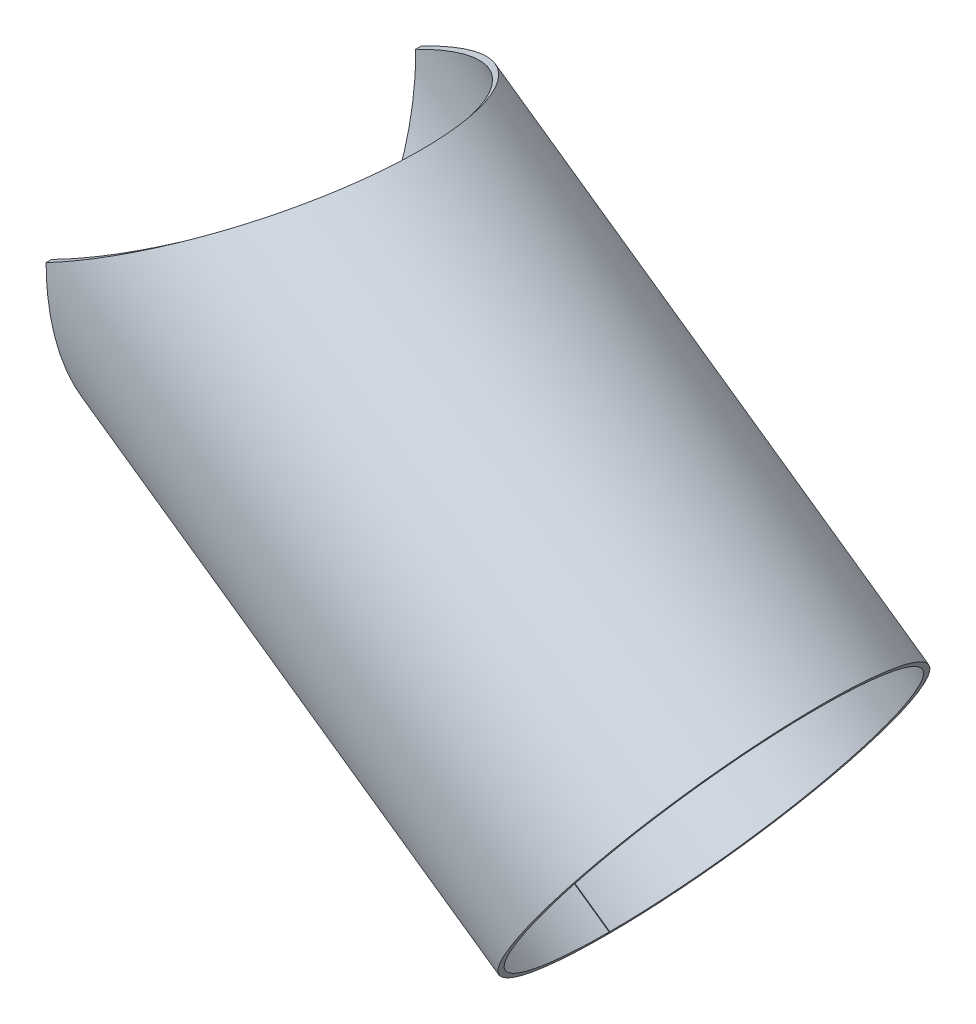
ISO-10303-21;
HEADER;
FILE_DESCRIPTION(('STEP AP214'),'2;1');
FILE_NAME('part.step','',(''),(''),'','','');
FILE_SCHEMA(('AUTOMOTIVE_DESIGN { 1 0 10303 214 1 1 1 1 }'));
ENDSEC;
DATA;
#1=APPLICATION_CONTEXT('core data for automotive mechanical design processes');
#2=APPLICATION_PROTOCOL_DEFINITION('international standard','automotive_design',2000,#1);
#3=PRODUCT_CONTEXT('',#1,'mechanical');
#4=PRODUCT('Part','Part','',(#3));
#5=PRODUCT_RELATED_PRODUCT_CATEGORY('part','',(#4));
#6=PRODUCT_DEFINITION_FORMATION('','',#4);
#7=PRODUCT_DEFINITION_CONTEXT('part definition',#1,'design');
#8=PRODUCT_DEFINITION('design','',#6,#7);
#9=PRODUCT_DEFINITION_SHAPE('','',#8);
#10=(LENGTH_UNIT() NAMED_UNIT(*) SI_UNIT(.MILLI.,.METRE.));
#11=(NAMED_UNIT(*) PLANE_ANGLE_UNIT() SI_UNIT($,.RADIAN.));
#12=(NAMED_UNIT(*) SI_UNIT($,.STERADIAN.) SOLID_ANGLE_UNIT());
#13=UNCERTAINTY_MEASURE_WITH_UNIT(LENGTH_MEASURE(1.E-05),#10,'distance_accuracy_value','');
#14=(GEOMETRIC_REPRESENTATION_CONTEXT(3) GLOBAL_UNCERTAINTY_ASSIGNED_CONTEXT((#13)) GLOBAL_UNIT_ASSIGNED_CONTEXT((#10,
#11,#12)) REPRESENTATION_CONTEXT('',''));
#15=CARTESIAN_POINT('',(0.,0.,0.));
#16=DIRECTION('',(0.,0.,1.));
#17=DIRECTION('',(1.,0.,0.));
#18=AXIS2_PLACEMENT_3D('',#15,#16,#17);
#19=CARTESIAN_POINT('',(-8.46545056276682E-13,-335.7124570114,-0.499999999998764));
#20=CARTESIAN_POINT('',(-0.00106268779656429,-335.70908512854,-1.68390167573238));
#21=CARTESIAN_POINT('',(-0.000353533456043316,-335.697947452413,-2.75725993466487));
#22=CARTESIAN_POINT('',(2.73555184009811E-05,-335.674363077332,-4.20142870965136));
#23=CARTESIAN_POINT('',(-7.10278870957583E-06,-335.66543496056,-4.65218471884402));
#24=CARTESIAN_POINT('',(1.09872932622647E-06,-335.644564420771,-5.57195339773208));
#25=CARTESIAN_POINT('',(3.01188604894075E-06,-335.632715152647,-6.03198956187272));
#26=CARTESIAN_POINT('',(8.77180831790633E-06,-335.566388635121,-8.33290025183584));
#27=CARTESIAN_POINT('',(9.24285155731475E-06,-335.490661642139,-10.1757275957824));
#28=CARTESIAN_POINT('',(-6.84551519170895E-06,-335.195564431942,-15.7016989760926));
#29=CARTESIAN_POINT('',(-1.65208361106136E-05,-334.908215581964,-19.3850722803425));
#30=CARTESIAN_POINT('',(-2.80299958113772E-05,-333.774080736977,-30.4229254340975));
#31=CARTESIAN_POINT('',(-7.61168239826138E-05,-332.655399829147,-37.7655413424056));
#32=CARTESIAN_POINT('',(-0.000131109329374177,-329.687783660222,-52.3941169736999));
#33=CARTESIAN_POINT('',(5.3550689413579E-05,-327.840550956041,-59.6730210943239));
#34=CARTESIAN_POINT('',(-3.05916689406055E-05,-323.409861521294,-74.141994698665));
#35=CARTESIAN_POINT('',(-5.31522316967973E-05,-320.825862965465,-81.3325494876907));
#36=CARTESIAN_POINT('',(0.000130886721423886,-314.920286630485,-95.5735862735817));
#37=CARTESIAN_POINT('',(5.29104093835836E-05,-311.594144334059,-102.634620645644));
#38=CARTESIAN_POINT('',(8.5395752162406E-05,-304.193833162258,-116.583370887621));
#39=CARTESIAN_POINT('',(-0.000234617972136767,-300.119319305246,-123.472958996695));
#40=CARTESIAN_POINT('',(-0.0007493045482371,-291.19047618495,-137.069956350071));
#41=CARTESIAN_POINT('',(-0.000607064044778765,-286.339628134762,-143.770803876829));
#42=CARTESIAN_POINT('',(7.61220968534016E-05,-275.865650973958,-156.912354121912));
#43=CARTESIAN_POINT('',(-0.000119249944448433,-270.248132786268,-163.346884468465));
#44=CARTESIAN_POINT('',(-0.000382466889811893,-258.216256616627,-175.922439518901));
#45=CARTESIAN_POINT('',(4.47459294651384E-05,-251.806391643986,-182.059014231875));
#46=CARTESIAN_POINT('',(-7.86089668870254E-05,-238.157685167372,-193.99163137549));
#47=CARTESIAN_POINT('',(3.6472310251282E-05,-230.907503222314,-199.797382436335));
#48=CARTESIAN_POINT('',(-4.48406124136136E-05,-215.531867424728,-211.009441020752));
#49=CARTESIAN_POINT('',(2.86664489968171E-05,-207.383072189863,-216.432829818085));
#50=CARTESIAN_POINT('',(-1.67382693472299E-05,-194.451287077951,-224.215140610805));
#51=CARTESIAN_POINT('',(-9.78898980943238E-05,-190.011195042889,-226.757205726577));
#52=CARTESIAN_POINT('',(-7.53018743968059E-05,-180.871564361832,-231.718318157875));
#53=CARTESIAN_POINT('',(2.94402320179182E-05,-176.177179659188,-234.134882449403));
#54=CARTESIAN_POINT('',(-4.68912785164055E-05,-166.506076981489,-238.836643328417));
#55=CARTESIAN_POINT('',(-0.000147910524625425,-161.51861739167,-241.126786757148));
#56=CARTESIAN_POINT('',(-7.76725775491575E-05,-151.239313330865,-245.559344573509));
#57=CARTESIAN_POINT('',(5.64019485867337E-05,-145.960202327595,-247.69717939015));
#58=CARTESIAN_POINT('',(-7.51937545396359E-05,-135.020306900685,-251.82631218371));
#59=CARTESIAN_POINT('',(-0.000116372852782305,-129.360220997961,-253.816509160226));
#60=CARTESIAN_POINT('',(-2.56133183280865E-05,-120.584719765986,-256.660667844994));
#61=CARTESIAN_POINT('',(8.64993435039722E-06,-117.617607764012,-257.58357425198));
#62=CARTESIAN_POINT('',(-5.93732338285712E-05,-111.552645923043,-259.387612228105));
#63=CARTESIAN_POINT('',(-0.000119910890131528,-108.455762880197,-260.268260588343));
#64=CARTESIAN_POINT('',(-0.000147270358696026,-102.132982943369,-261.979044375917));
#65=CARTESIAN_POINT('',(-0.000113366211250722,-98.907085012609,-262.809179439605));
#66=CARTESIAN_POINT('',(-1.9008595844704E-05,-92.3263712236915,-264.410869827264));
#67=CARTESIAN_POINT('',(2.62762660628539E-05,-88.9846790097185,-265.179712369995));
#68=CARTESIAN_POINT('',(-0.000163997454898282,-78.6482225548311,-267.410734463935));
#69=CARTESIAN_POINT('',(-0.000179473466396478,-71.3420994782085,-268.79592159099));
#70=CARTESIAN_POINT('',(-9.42753775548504E-06,-61.6904338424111,-270.321888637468));
#71=CARTESIAN_POINT('',(1.96557193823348E-05,-59.7448998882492,-270.615287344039));
#72=CARTESIAN_POINT('',(-6.04871756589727E-05,-55.7407025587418,-271.187984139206));
#73=CARTESIAN_POINT('',(-0.000148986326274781,-53.6803755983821,-271.467320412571));
#74=CARTESIAN_POINT('',(-0.000347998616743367,-47.3244073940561,-272.276567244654));
#75=CARTESIAN_POINT('',(-0.000337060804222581,-42.8537003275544,-272.77785877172));
#76=CARTESIAN_POINT('',(-0.000121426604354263,-35.797570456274,-273.438987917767));
#77=CARTESIAN_POINT('',(-2.92816414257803E-05,-33.3872007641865,-273.644193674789));
#78=CARTESIAN_POINT('',(4.06213399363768E-06,-29.6843498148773,-273.924740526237));
#79=CARTESIAN_POINT('',(-7.71729458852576E-06,-28.4323971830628,-274.014057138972));
#80=CARTESIAN_POINT('',(-2.82585385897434E-05,-25.8237314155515,-274.187299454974));
#81=CARTESIAN_POINT('',(-3.75865300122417E-05,-24.4763035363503,-274.270500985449));
#82=CARTESIAN_POINT('',(-3.81755844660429E-05,-21.6952346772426,-274.427530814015));
#83=CARTESIAN_POINT('',(-2.92459149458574E-05,-20.2615934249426,-274.501359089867));
#84=CARTESIAN_POINT('',(-1.31328913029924E-05,-18.0464871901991,-274.603050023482));
#85=CARTESIAN_POINT('',(-7.56879687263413E-06,-17.2973447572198,-274.635437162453));
#86=CARTESIAN_POINT('',(-2.85290695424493E-06,-16.1574761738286,-274.681489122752));
#87=CARTESIAN_POINT('',(-1.90458553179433E-06,-15.7748275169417,-274.696418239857));
#88=CARTESIAN_POINT('',(-2.13993179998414E-06,-15.0041465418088,-274.725388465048));
#89=CARTESIAN_POINT('',(-3.4290343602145E-06,-14.6179317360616,-274.739388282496));
#90=CARTESIAN_POINT('',(-7.38696003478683E-05,-10.8858353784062,-274.868843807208));
#91=CARTESIAN_POINT('',(-1.57221265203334E-06,-6.15159425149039,-275.));
#92=CARTESIAN_POINT('',(-2.21927742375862E-12,8.08495632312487E-13,-275.));
#93=CARTESIAN_POINT('',(4.58860390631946,-329.15925148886,-0.485454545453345));
#94=CARTESIAN_POINT('',(4.58750530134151,-329.155930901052,-1.63491544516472));
#95=CARTESIAN_POINT('',(4.58805543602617,-329.14502032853,-2.67704873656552));
#96=CARTESIAN_POINT('',(4.58811032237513,-329.121901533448,-4.07920532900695));
#97=CARTESIAN_POINT('',(4.5879541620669,-329.113147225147,-4.51684843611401));
#98=CARTESIAN_POINT('',(4.58767702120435,-329.092684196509,-5.40986020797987));
#99=CARTESIAN_POINT('',(4.58751695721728,-329.081066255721,-5.85651350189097));
#100=CARTESIAN_POINT('',(4.58661609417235,-329.016034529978,-8.09048860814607));
#101=CARTESIAN_POINT('',(4.58558150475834,-328.941785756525,-9.87970642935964));
#102=CARTESIAN_POINT('',(4.5815321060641,-328.652448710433,-15.2449222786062));
#103=CARTESIAN_POINT('',(4.57759496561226,-328.370708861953,-18.8211429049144));
#104=CARTESIAN_POINT('',(4.56208192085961,-327.258712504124,-29.5378948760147));
#105=CARTESIAN_POINT('',(4.54674387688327,-326.161867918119,-36.6669074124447));
#106=CARTESIAN_POINT('',(4.5061272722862,-323.252179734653,-50.8699244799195));
#107=CARTESIAN_POINT('',(4.48106171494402,-321.441008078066,-57.937078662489));
#108=CARTESIAN_POINT('',(4.42041857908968,-317.09680584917,-71.9851366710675));
#109=CARTESIAN_POINT('',(4.38507747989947,-314.563247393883,-78.9665116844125));
#110=CARTESIAN_POINT('',(4.30454082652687,-308.772952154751,-92.7932637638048));
#111=CARTESIAN_POINT('',(4.25900103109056,-305.51173606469,-99.6488862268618));
#112=CARTESIAN_POINT('',(4.15788385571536,-298.255881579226,-113.191854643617));
#113=CARTESIAN_POINT('',(4.10187540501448,-294.260899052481,-119.881018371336));
#114=CARTESIAN_POINT('',(3.97932392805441,-285.50634253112,-133.082466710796));
#115=CARTESIAN_POINT('',(3.91316217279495,-280.750186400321,-139.588380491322));
#116=CARTESIAN_POINT('',(3.77067781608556,-270.480673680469,-152.347631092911));
#117=CARTESIAN_POINT('',(3.69370263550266,-264.972808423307,-158.594975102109));
#118=CARTESIAN_POINT('',(3.52898717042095,-253.175794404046,-170.804695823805));
#119=CARTESIAN_POINT('',(3.4417986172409,-246.891057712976,-176.762751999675));
#120=CARTESIAN_POINT('',(3.25512242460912,-233.508776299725,-188.348238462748));
#121=CARTESIAN_POINT('',(3.15613905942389,-226.400121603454,-193.985094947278));
#122=CARTESIAN_POINT('',(2.94590039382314,-211.324621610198,-204.870984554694));
#123=CARTESIAN_POINT('',(2.83459337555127,-203.334894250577,-210.136602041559));
#124=CARTESIAN_POINT('',(2.65779345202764,-190.655540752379,-217.692518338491));
#125=CARTESIAN_POINT('',(2.59702476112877,-186.30211950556,-220.160632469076));
#126=CARTESIAN_POINT('',(2.47212431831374,-177.340897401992,-224.977421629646));
#127=CARTESIAN_POINT('',(2.40806400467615,-172.738149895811,-227.323685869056));
#128=CARTESIAN_POINT('',(2.27580129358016,-163.255828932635,-231.888668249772));
#129=CARTESIAN_POINT('',(2.20753136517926,-158.365724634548,-234.112189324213));
#130=CARTESIAN_POINT('',(2.06710076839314,-148.287076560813,-238.415800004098));
#131=CARTESIAN_POINT('',(1.99507731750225,-143.111017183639,-240.491443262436));
#132=CARTESIAN_POINT('',(1.84541768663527,-132.3846699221,-244.500455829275));
#133=CARTESIAN_POINT('',(1.76801339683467,-126.83506999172,-246.432756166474));
#134=CARTESIAN_POINT('',(1.64815748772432,-118.230870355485,-249.194175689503));
#135=CARTESIAN_POINT('',(1.60763617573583,-115.321677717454,-250.090233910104));
#136=CARTESIAN_POINT('',(1.52467135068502,-109.37510477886,-251.84179078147));
#137=CARTESIAN_POINT('',(1.4822824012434,-106.338672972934,-252.696820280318));
#138=CARTESIAN_POINT('',(1.39583392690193,-100.139315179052,-254.357835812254));
#139=CARTESIAN_POINT('',(1.35177510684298,-96.976388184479,-255.163821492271));
#140=CARTESIAN_POINT('',(1.2619216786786,-90.5241331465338,-256.718917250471));
#141=CARTESIAN_POINT('',(1.21629142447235,-87.2476723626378,-257.465393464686));
#142=CARTESIAN_POINT('',(1.07482163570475,-77.1129839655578,-259.631513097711));
#143=CARTESIAN_POINT('',(0.974944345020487,-69.9494783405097,-260.976403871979));
#144=CARTESIAN_POINT('',(0.843191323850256,-60.4862183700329,-262.457979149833));
#145=CARTESIAN_POINT('',(0.816628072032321,-58.578662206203,-262.742842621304));
#146=CARTESIAN_POINT('',(0.761818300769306,-54.6526268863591,-263.298879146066));
#147=CARTESIAN_POINT('',(0.733569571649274,-52.6325169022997,-263.570089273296));
#148=CARTESIAN_POINT('',(0.646497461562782,-46.4006163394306,-264.355794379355));
#149=CARTESIAN_POINT('',(0.585401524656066,-42.0171789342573,-264.842502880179));
#150=CARTESIAN_POINT('',(0.48917010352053,-35.0987897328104,-265.484399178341));
#151=CARTESIAN_POINT('',(0.456315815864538,-32.7354724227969,-265.68363531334));
#152=CARTESIAN_POINT('',(0.405737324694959,-29.1049026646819,-265.956020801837));
#153=CARTESIAN_POINT('',(0.388613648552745,-27.8773883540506,-266.042739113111));
#154=CARTESIAN_POINT('',(0.352937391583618,-25.3196442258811,-266.210941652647));
#155=CARTESIAN_POINT('',(0.334511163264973,-23.9985184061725,-266.291722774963));
#156=CARTESIAN_POINT('',(0.296498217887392,-21.2717368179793,-266.444184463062));
#157=CARTESIAN_POINT('',(0.276911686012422,-19.8660807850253,-266.515865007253));
#158=CARTESIAN_POINT('',(0.246651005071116,-17.6942142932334,-266.614597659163));
#159=CARTESIAN_POINT('',(0.236417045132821,-16.9596954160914,-266.646042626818));
#160=CARTESIAN_POINT('',(0.220841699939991,-15.8420774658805,-266.690754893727));
#161=CARTESIAN_POINT('',(0.215612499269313,-15.4668982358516,-266.705249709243));
#162=CARTESIAN_POINT('',(0.205078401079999,-14.7112611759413,-266.733377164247));
#163=CARTESIAN_POINT('',(0.199798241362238,-14.3325853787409,-266.746969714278));
#164=CARTESIAN_POINT('',(0.1487172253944,-10.6733396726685,-266.872659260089));
#165=CARTESIAN_POINT('',(0.0840799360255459,-6.0315080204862,-267.));
#166=CARTESIAN_POINT('',(-2.19266533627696E-12,8.151486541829E-13,-267.));
#167=B_SPLINE_SURFACE_WITH_KNOTS('',1,3,((#19,#20,#21,#22,#23,#24,#25,#26,#27,#28,#29,#30,#31,
#32,#33,#34,#35,#36,#37,#38,#39,#40,#41,#42,#43,#44,#45,#46,#47,#48,#49,#50,#51,#52,#53,#54,#55,
#56,#57,#58,#59,#60,#61,#62,#63,#64,#65,#66,#67,#68,#69,#70,#71,#72,#73,#74,#75,#76,#77,#78,#79,
#80,#81,#82,#83,#84,#85,#86,#87,#88,#89,#90,#91,#92),(#93,#94,#95,#96,#97,#98,#99,#100,#101,
#102,#103,#104,#105,#106,#107,#108,#109,#110,#111,#112,#113,#114,#115,#116,#117,#118,#119,#120,
#121,#122,#123,#124,#125,#126,#127,#128,#129,#130,#131,#132,#133,#134,#135,#136,#137,#138,#139,
#140,#141,#142,#143,#144,#145,#146,#147,#148,#149,#150,#151,#152,#153,#154,#155,#156,#157,#158,
#159,#160,#161,#162,#163,#164,#165,#166)),.UNSPECIFIED.,.F.,.F.,.F.,(2,2),(4,2,2,2,2,2,2,2,2,2,
2,2,2,2,2,2,2,2,2,2,2,2,2,2,2,2,2,2,2,2,2,2,2,2,2,2,4),(0.,1.),(0.,0.0078125,0.01171875,
0.015625,0.03125,0.0625,0.125,0.1875,0.25,0.3125,0.375,0.4375,0.5,0.5625,0.625,0.6875,0.71875,
0.75,0.78125,0.8125,0.84375,0.859375,0.875,0.890625,0.90625,0.9375,0.9453125,0.953125,0.96875,
0.9765625,0.98046875,0.984375,0.98828125,0.990234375,0.9912109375,0.9921875,1.),.UNSPECIFIED.);
#168=CARTESIAN_POINT('',(-8.46545056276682E-13,-335.7124570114,-0.499999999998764));
#169=CARTESIAN_POINT('',(4.58860390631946,-329.15925148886,-0.485454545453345));
#170=B_SPLINE_CURVE_WITH_KNOTS('',1,(#168,#169),.UNSPECIFIED.,.F.,.F.,(2,2),(0.,1.),.UNSPECIFIED.);
#171=CARTESIAN_POINT('',(4.58860390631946,-329.15925148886,-0.485454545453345));
#172=VERTEX_POINT('',#171);
#173=CARTESIAN_POINT('',(-8.32667268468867E-13,-335.7124570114,-0.499999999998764));
#174=VERTEX_POINT('',#173);
#175=EDGE_CURVE('E13',#172,#174,#170,.F.);
#176=CARTESIAN_POINT('',(4.58860390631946,-329.15925148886,-0.485454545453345));
#177=CARTESIAN_POINT('',(4.58750530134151,-329.155930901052,-1.63491544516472));
#178=CARTESIAN_POINT('',(4.58805543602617,-329.14502032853,-2.67704873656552));
#179=CARTESIAN_POINT('',(4.58811032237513,-329.121901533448,-4.07920532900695));
#180=CARTESIAN_POINT('',(4.5879541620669,-329.113147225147,-4.51684843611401));
#181=CARTESIAN_POINT('',(4.58767702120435,-329.092684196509,-5.40986020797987));
#182=CARTESIAN_POINT('',(4.58751695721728,-329.081066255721,-5.85651350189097));
#183=CARTESIAN_POINT('',(4.58661609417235,-329.016034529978,-8.09048860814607));
#184=CARTESIAN_POINT('',(4.58558150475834,-328.941785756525,-9.87970642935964));
#185=CARTESIAN_POINT('',(4.5815321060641,-328.652448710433,-15.2449222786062));
#186=CARTESIAN_POINT('',(4.57759496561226,-328.370708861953,-18.8211429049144));
#187=CARTESIAN_POINT('',(4.56208192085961,-327.258712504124,-29.5378948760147));
#188=CARTESIAN_POINT('',(4.54674387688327,-326.161867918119,-36.6669074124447));
#189=CARTESIAN_POINT('',(4.5061272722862,-323.252179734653,-50.8699244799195));
#190=CARTESIAN_POINT('',(4.48106171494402,-321.441008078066,-57.937078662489));
#191=CARTESIAN_POINT('',(4.42041857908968,-317.09680584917,-71.9851366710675));
#192=CARTESIAN_POINT('',(4.38507747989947,-314.563247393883,-78.9665116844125));
#193=CARTESIAN_POINT('',(4.30454082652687,-308.772952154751,-92.7932637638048));
#194=CARTESIAN_POINT('',(4.25900103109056,-305.51173606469,-99.6488862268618));
#195=CARTESIAN_POINT('',(4.15788385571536,-298.255881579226,-113.191854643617));
#196=CARTESIAN_POINT('',(4.10187540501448,-294.260899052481,-119.881018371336));
#197=CARTESIAN_POINT('',(3.97932392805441,-285.50634253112,-133.082466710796));
#198=CARTESIAN_POINT('',(3.91316217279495,-280.750186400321,-139.588380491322));
#199=CARTESIAN_POINT('',(3.77067781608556,-270.480673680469,-152.347631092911));
#200=CARTESIAN_POINT('',(3.69370263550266,-264.972808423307,-158.594975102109));
#201=CARTESIAN_POINT('',(3.52898717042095,-253.175794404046,-170.804695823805));
#202=CARTESIAN_POINT('',(3.4417986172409,-246.891057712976,-176.762751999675));
#203=CARTESIAN_POINT('',(3.25512242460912,-233.508776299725,-188.348238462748));
#204=CARTESIAN_POINT('',(3.15613905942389,-226.400121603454,-193.985094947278));
#205=CARTESIAN_POINT('',(2.94590039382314,-211.324621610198,-204.870984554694));
#206=CARTESIAN_POINT('',(2.83459337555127,-203.334894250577,-210.136602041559));
#207=CARTESIAN_POINT('',(2.65779345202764,-190.655540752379,-217.692518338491));
#208=CARTESIAN_POINT('',(2.59702476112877,-186.30211950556,-220.160632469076));
#209=CARTESIAN_POINT('',(2.47212431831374,-177.340897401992,-224.977421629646));
#210=CARTESIAN_POINT('',(2.40806400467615,-172.738149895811,-227.323685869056));
#211=CARTESIAN_POINT('',(2.27580129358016,-163.255828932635,-231.888668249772));
#212=CARTESIAN_POINT('',(2.20753136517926,-158.365724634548,-234.112189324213));
#213=CARTESIAN_POINT('',(2.06710076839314,-148.287076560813,-238.415800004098));
#214=CARTESIAN_POINT('',(1.99507731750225,-143.111017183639,-240.491443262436));
#215=CARTESIAN_POINT('',(1.84541768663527,-132.3846699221,-244.500455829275));
#216=CARTESIAN_POINT('',(1.76801339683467,-126.83506999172,-246.432756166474));
#217=CARTESIAN_POINT('',(1.64815748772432,-118.230870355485,-249.194175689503));
#218=CARTESIAN_POINT('',(1.60763617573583,-115.321677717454,-250.090233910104));
#219=CARTESIAN_POINT('',(1.52467135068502,-109.37510477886,-251.84179078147));
#220=CARTESIAN_POINT('',(1.4822824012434,-106.338672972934,-252.696820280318));
#221=CARTESIAN_POINT('',(1.39583392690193,-100.139315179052,-254.357835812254));
#222=CARTESIAN_POINT('',(1.35177510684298,-96.976388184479,-255.163821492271));
#223=CARTESIAN_POINT('',(1.2619216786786,-90.5241331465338,-256.718917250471));
#224=CARTESIAN_POINT('',(1.21629142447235,-87.2476723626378,-257.465393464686));
#225=CARTESIAN_POINT('',(1.07482163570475,-77.1129839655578,-259.631513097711));
#226=CARTESIAN_POINT('',(0.974944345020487,-69.9494783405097,-260.976403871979));
#227=CARTESIAN_POINT('',(0.843191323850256,-60.4862183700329,-262.457979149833));
#228=CARTESIAN_POINT('',(0.816628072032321,-58.578662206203,-262.742842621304));
#229=CARTESIAN_POINT('',(0.761818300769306,-54.6526268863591,-263.298879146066));
#230=CARTESIAN_POINT('',(0.733569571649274,-52.6325169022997,-263.570089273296));
#231=CARTESIAN_POINT('',(0.646497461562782,-46.4006163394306,-264.355794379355));
#232=CARTESIAN_POINT('',(0.585401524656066,-42.0171789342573,-264.842502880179));
#233=CARTESIAN_POINT('',(0.48917010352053,-35.0987897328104,-265.484399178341));
#234=CARTESIAN_POINT('',(0.456315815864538,-32.7354724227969,-265.68363531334));
#235=CARTESIAN_POINT('',(0.405737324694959,-29.1049026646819,-265.956020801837));
#236=CARTESIAN_POINT('',(0.388613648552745,-27.8773883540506,-266.042739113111));
#237=CARTESIAN_POINT('',(0.352937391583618,-25.3196442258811,-266.210941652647));
#238=CARTESIAN_POINT('',(0.334511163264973,-23.9985184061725,-266.291722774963));
#239=CARTESIAN_POINT('',(0.296498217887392,-21.2717368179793,-266.444184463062));
#240=CARTESIAN_POINT('',(0.276911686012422,-19.8660807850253,-266.515865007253));
#241=CARTESIAN_POINT('',(0.246651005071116,-17.6942142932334,-266.614597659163));
#242=CARTESIAN_POINT('',(0.236417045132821,-16.9596954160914,-266.646042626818));
#243=CARTESIAN_POINT('',(0.220841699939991,-15.8420774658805,-266.690754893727));
#244=CARTESIAN_POINT('',(0.215612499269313,-15.4668982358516,-266.705249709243));
#245=CARTESIAN_POINT('',(0.205078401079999,-14.7112611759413,-266.733377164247));
#246=CARTESIAN_POINT('',(0.199798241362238,-14.3325853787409,-266.746969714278));
#247=CARTESIAN_POINT('',(0.1487172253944,-10.6733396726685,-266.872659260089));
#248=CARTESIAN_POINT('',(0.0840799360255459,-6.0315080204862,-267.));
#249=CARTESIAN_POINT('',(-2.19266533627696E-12,8.151486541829E-13,-267.));
#250=B_SPLINE_CURVE_WITH_KNOTS('',3,(#176,#177,#178,#179,#180,#181,#182,#183,#184,#185,#186,
#187,#188,#189,#190,#191,#192,#193,#194,#195,#196,#197,#198,#199,#200,#201,#202,#203,#204,#205,
#206,#207,#208,#209,#210,#211,#212,#213,#214,#215,#216,#217,#218,#219,#220,#221,#222,#223,#224,
#225,#226,#227,#228,#229,#230,#231,#232,#233,#234,#235,#236,#237,#238,#239,#240,#241,#242,#243,
#244,#245,#246,#247,#248,#249),.UNSPECIFIED.,.F.,.F.,(4,2,2,2,2,2,2,2,2,2,2,2,2,2,2,2,2,2,2,2,2,
2,2,2,2,2,2,2,2,2,2,2,2,2,2,2,4),(0.,0.0078125,0.01171875,0.015625,0.03125,0.0625,0.125,0.1875,
0.25,0.3125,0.375,0.4375,0.5,0.5625,0.625,0.6875,0.71875,0.75,0.78125,0.8125,0.84375,0.859375,
0.875,0.890625,0.90625,0.9375,0.9453125,0.953125,0.96875,0.9765625,0.98046875,0.984375,
0.98828125,0.990234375,0.9912109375,0.9921875,1.),.UNSPECIFIED.);
#251=CARTESIAN_POINT('',(-4.16308496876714E-13,-5.17118975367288E-13,-267.));
#252=VERTEX_POINT('',#251);
#253=EDGE_CURVE('E91',#172,#252,#250,.T.);
#254=CARTESIAN_POINT('',(-2.19266533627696E-12,8.151486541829E-13,-267.));
#255=CARTESIAN_POINT('',(-2.21927742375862E-12,8.08495632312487E-13,-275.));
#256=B_SPLINE_CURVE_WITH_KNOTS('',1,(#254,#255),.UNSPECIFIED.,.F.,.F.,(2,2),(0.,1.),.UNSPECIFIED.);
#257=CARTESIAN_POINT('',(-2.0808149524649E-12,-5.05662426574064E-07,-275.));
#258=VERTEX_POINT('',#257);
#259=EDGE_CURVE('E51',#252,#258,#256,.T.);
#260=CARTESIAN_POINT('',(-2.21927742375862E-12,8.08495632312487E-13,-275.));
#261=CARTESIAN_POINT('',(-1.57221265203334E-06,-6.15159425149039,-275.));
#262=CARTESIAN_POINT('',(-7.38696003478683E-05,-10.8858353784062,-274.868843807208));
#263=CARTESIAN_POINT('',(-3.4290343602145E-06,-14.6179317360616,-274.739388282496));
#264=CARTESIAN_POINT('',(-2.13993179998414E-06,-15.0041465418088,-274.725388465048));
#265=CARTESIAN_POINT('',(-1.90458553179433E-06,-15.7748275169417,-274.696418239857));
#266=CARTESIAN_POINT('',(-2.85290695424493E-06,-16.1574761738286,-274.681489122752));
#267=CARTESIAN_POINT('',(-7.56879687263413E-06,-17.2973447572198,-274.635437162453));
#268=CARTESIAN_POINT('',(-1.31328913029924E-05,-18.0464871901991,-274.603050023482));
#269=CARTESIAN_POINT('',(-2.92459149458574E-05,-20.2615934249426,-274.501359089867));
#270=CARTESIAN_POINT('',(-3.81755844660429E-05,-21.6952346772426,-274.427530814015));
#271=CARTESIAN_POINT('',(-3.75865300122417E-05,-24.4763035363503,-274.270500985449));
#272=CARTESIAN_POINT('',(-2.82585385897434E-05,-25.8237314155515,-274.187299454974));
#273=CARTESIAN_POINT('',(-7.71729458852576E-06,-28.4323971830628,-274.014057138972));
#274=CARTESIAN_POINT('',(4.06213399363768E-06,-29.6843498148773,-273.924740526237));
#275=CARTESIAN_POINT('',(-2.92816414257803E-05,-33.3872007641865,-273.644193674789));
#276=CARTESIAN_POINT('',(-0.000121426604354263,-35.797570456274,-273.438987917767));
#277=CARTESIAN_POINT('',(-0.000337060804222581,-42.8537003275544,-272.77785877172));
#278=CARTESIAN_POINT('',(-0.000347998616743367,-47.3244073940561,-272.276567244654));
#279=CARTESIAN_POINT('',(-0.000148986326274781,-53.6803755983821,-271.467320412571));
#280=CARTESIAN_POINT('',(-6.04871756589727E-05,-55.7407025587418,-271.187984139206));
#281=CARTESIAN_POINT('',(1.96557193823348E-05,-59.7448998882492,-270.615287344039));
#282=CARTESIAN_POINT('',(-9.42753775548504E-06,-61.6904338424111,-270.321888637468));
#283=CARTESIAN_POINT('',(-0.000179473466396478,-71.3420994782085,-268.79592159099));
#284=CARTESIAN_POINT('',(-0.000163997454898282,-78.6482225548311,-267.410734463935));
#285=CARTESIAN_POINT('',(2.62762660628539E-05,-88.9846790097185,-265.179712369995));
#286=CARTESIAN_POINT('',(-1.9008595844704E-05,-92.3263712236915,-264.410869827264));
#287=CARTESIAN_POINT('',(-0.000113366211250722,-98.907085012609,-262.809179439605));
#288=CARTESIAN_POINT('',(-0.000147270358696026,-102.132982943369,-261.979044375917));
#289=CARTESIAN_POINT('',(-0.000119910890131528,-108.455762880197,-260.268260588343));
#290=CARTESIAN_POINT('',(-5.93732338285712E-05,-111.552645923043,-259.387612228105));
#291=CARTESIAN_POINT('',(8.64993435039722E-06,-117.617607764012,-257.58357425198));
#292=CARTESIAN_POINT('',(-2.56133183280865E-05,-120.584719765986,-256.660667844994));
#293=CARTESIAN_POINT('',(-0.000116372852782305,-129.360220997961,-253.816509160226));
#294=CARTESIAN_POINT('',(-7.51937545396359E-05,-135.020306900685,-251.82631218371));
#295=CARTESIAN_POINT('',(5.64019485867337E-05,-145.960202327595,-247.69717939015));
#296=CARTESIAN_POINT('',(-7.76725775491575E-05,-151.239313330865,-245.559344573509));
#297=CARTESIAN_POINT('',(-0.000147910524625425,-161.51861739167,-241.126786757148));
#298=CARTESIAN_POINT('',(-4.68912785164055E-05,-166.506076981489,-238.836643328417));
#299=CARTESIAN_POINT('',(2.94402320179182E-05,-176.177179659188,-234.134882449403));
#300=CARTESIAN_POINT('',(-7.53018743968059E-05,-180.871564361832,-231.718318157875));
#301=CARTESIAN_POINT('',(-9.78898980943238E-05,-190.011195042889,-226.757205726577));
#302=CARTESIAN_POINT('',(-1.67382693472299E-05,-194.451287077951,-224.215140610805));
#303=CARTESIAN_POINT('',(2.86664489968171E-05,-207.383072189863,-216.432829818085));
#304=CARTESIAN_POINT('',(-4.48406124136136E-05,-215.531867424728,-211.009441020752));
#305=CARTESIAN_POINT('',(3.6472310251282E-05,-230.907503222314,-199.797382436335));
#306=CARTESIAN_POINT('',(-7.86089668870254E-05,-238.157685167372,-193.99163137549));
#307=CARTESIAN_POINT('',(4.47459294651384E-05,-251.806391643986,-182.059014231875));
#308=CARTESIAN_POINT('',(-0.000382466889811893,-258.216256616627,-175.922439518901));
#309=CARTESIAN_POINT('',(-0.000119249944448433,-270.248132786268,-163.346884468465));
#310=CARTESIAN_POINT('',(7.61220968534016E-05,-275.865650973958,-156.912354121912));
#311=CARTESIAN_POINT('',(-0.000607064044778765,-286.339628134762,-143.770803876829));
#312=CARTESIAN_POINT('',(-0.0007493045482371,-291.19047618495,-137.069956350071));
#313=CARTESIAN_POINT('',(-0.000234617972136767,-300.119319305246,-123.472958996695));
#314=CARTESIAN_POINT('',(8.5395752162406E-05,-304.193833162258,-116.583370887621));
#315=CARTESIAN_POINT('',(5.29104093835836E-05,-311.594144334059,-102.634620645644));
#316=CARTESIAN_POINT('',(0.000130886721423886,-314.920286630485,-95.5735862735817));
#317=CARTESIAN_POINT('',(-5.31522316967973E-05,-320.825862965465,-81.3325494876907));
#318=CARTESIAN_POINT('',(-3.05916689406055E-05,-323.409861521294,-74.141994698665));
#319=CARTESIAN_POINT('',(5.3550689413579E-05,-327.840550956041,-59.6730210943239));
#320=CARTESIAN_POINT('',(-0.000131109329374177,-329.687783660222,-52.3941169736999));
#321=CARTESIAN_POINT('',(-7.61168239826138E-05,-332.655399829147,-37.7655413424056));
#322=CARTESIAN_POINT('',(-2.80299958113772E-05,-333.774080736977,-30.4229254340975));
#323=CARTESIAN_POINT('',(-1.65208361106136E-05,-334.908215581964,-19.3850722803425));
#324=CARTESIAN_POINT('',(-6.84551519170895E-06,-335.195564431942,-15.7016989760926));
#325=CARTESIAN_POINT('',(9.24285155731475E-06,-335.490661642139,-10.1757275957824));
#326=CARTESIAN_POINT('',(8.77180831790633E-06,-335.566388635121,-8.33290025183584));
#327=CARTESIAN_POINT('',(3.01188604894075E-06,-335.632715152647,-6.03198956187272));
#328=CARTESIAN_POINT('',(1.09872932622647E-06,-335.644564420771,-5.57195339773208));
#329=CARTESIAN_POINT('',(-7.10278870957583E-06,-335.66543496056,-4.65218471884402));
#330=CARTESIAN_POINT('',(2.73555184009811E-05,-335.674363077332,-4.20142870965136));
#331=CARTESIAN_POINT('',(-0.000353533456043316,-335.697947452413,-2.75725993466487));
#332=CARTESIAN_POINT('',(-0.00106268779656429,-335.70908512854,-1.68390167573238));
#333=CARTESIAN_POINT('',(-8.46545056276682E-13,-335.7124570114,-0.499999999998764));
#334=B_SPLINE_CURVE_WITH_KNOTS('',3,(#260,#261,#262,#263,#264,#265,#266,#267,#268,#269,#270,
#271,#272,#273,#274,#275,#276,#277,#278,#279,#280,#281,#282,#283,#284,#285,#286,#287,#288,#289,
#290,#291,#292,#293,#294,#295,#296,#297,#298,#299,#300,#301,#302,#303,#304,#305,#306,#307,#308,
#309,#310,#311,#312,#313,#314,#315,#316,#317,#318,#319,#320,#321,#322,#323,#324,#325,#326,#327,
#328,#329,#330,#331,#332,#333),.UNSPECIFIED.,.F.,.F.,(4,2,2,2,2,2,2,2,2,2,2,2,2,2,2,2,2,2,2,2,2,
2,2,2,2,2,2,2,2,2,2,2,2,2,2,2,4),(0.,0.0078125,0.0087890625,0.009765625,0.01171875,0.015625,
0.01953125,0.0234375,0.03125,0.046875,0.0546875,0.0625,0.09375,0.109375,0.125,0.140625,0.15625,
0.1875,0.21875,0.25,0.28125,0.3125,0.375,0.4375,0.5,0.5625,0.625,0.6875,0.75,0.8125,0.875,
0.9375,0.96875,0.984375,0.98828125,0.9921875,1.),.UNSPECIFIED.);
#335=EDGE_CURVE('E94',#174,#258,#334,.F.);
#336=ORIENTED_EDGE('',*,*,#175,.F.);
#337=ORIENTED_EDGE('',*,*,#253,.T.);
#338=ORIENTED_EDGE('',*,*,#259,.T.);
#339=ORIENTED_EDGE('',*,*,#335,.F.);
#340=EDGE_LOOP('',(#336,#337,#338,#339));
#341=FACE_BOUND('',#340,.T.);
#342=ADVANCED_FACE('F40',(#341),#167,.T.);
#343=CARTESIAN_POINT('',(-4.43857438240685E-13,3.20537003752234E-12,275.));
#344=CARTESIAN_POINT('',(5.04516890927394,2.62635757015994,275.));
#345=CARTESIAN_POINT('',(8.96115689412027,4.66498268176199,274.868112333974));
#346=CARTESIAN_POINT('',(12.4453039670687,6.47861338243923,274.719130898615));
#347=CARTESIAN_POINT('',(13.0572392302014,6.79716817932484,274.690542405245));
#348=CARTESIAN_POINT('',(14.2975939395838,7.44286048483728,274.628775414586));
#349=CARTESIAN_POINT('',(14.9094140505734,7.76135893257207,274.596202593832));
#350=CARTESIAN_POINT('',(16.7197942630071,8.70379917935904,274.49391453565));
#351=CARTESIAN_POINT('',(17.8932732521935,9.31468446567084,274.419634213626));
#352=CARTESIAN_POINT('',(21.3133580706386,11.0950747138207,274.182353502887));
#353=CARTESIAN_POINT('',(23.4573270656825,12.2111131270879,274.005197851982));
#354=CARTESIAN_POINT('',(27.4870034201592,14.3088294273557,273.630333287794));
#355=CARTESIAN_POINT('',(29.4566844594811,15.3342610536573,273.424673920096));
#356=CARTESIAN_POINT('',(35.2299632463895,18.3398580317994,272.761511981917));
#357=CARTESIAN_POINT('',(38.897746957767,20.2492544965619,272.257953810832));
#358=CARTESIAN_POINT('',(44.1276623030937,22.9716226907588,271.442160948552));
#359=CARTESIAN_POINT('',(45.8256871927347,23.8554764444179,271.160122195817));
#360=CARTESIAN_POINT('',(49.1312892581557,25.5761403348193,270.580729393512));
#361=CARTESIAN_POINT('',(50.7306519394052,26.4086988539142,270.285019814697));
#362=CARTESIAN_POINT('',(58.6310005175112,30.5214555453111,268.754244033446));
#363=CARTESIAN_POINT('',(64.6247806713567,33.6417383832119,267.363000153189));
#364=CARTESIAN_POINT('',(73.1252242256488,38.066595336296,265.115615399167));
#365=CARTESIAN_POINT('',(75.8668814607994,39.4938027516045,264.342803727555));
#366=CARTESIAN_POINT('',(81.2546223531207,42.2985986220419,262.736698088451));
#367=CARTESIAN_POINT('',(83.8981360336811,43.674795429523,261.903682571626));
#368=CARTESIAN_POINT('',(89.0843026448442,46.3745765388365,260.185350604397));
#369=CARTESIAN_POINT('',(91.6269562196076,47.6981617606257,259.300034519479));
#370=CARTESIAN_POINT('',(96.6114627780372,50.2928056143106,257.484466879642));
#371=CARTESIAN_POINT('',(99.0493086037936,51.5617838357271,256.55582598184));
#372=CARTESIAN_POINT('',(106.24197632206,55.3060225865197,253.701135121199));
#373=CARTESIAN_POINT('',(110.890262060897,57.7258924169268,251.70007093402));
#374=CARTESIAN_POINT('',(119.892556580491,62.4121610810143,247.538593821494));
#375=CARTESIAN_POINT('',(124.238361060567,64.6743940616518,245.382733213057));
#376=CARTESIAN_POINT('',(132.692345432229,69.075362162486,240.916116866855));
#377=CARTESIAN_POINT('',(136.797896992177,71.2125847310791,238.605996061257));
#378=CARTESIAN_POINT('',(144.766087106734,75.3604615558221,233.857410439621));
#379=CARTESIAN_POINT('',(148.625365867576,77.3694866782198,231.421447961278));
#380=CARTESIAN_POINT('',(156.143136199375,81.2830673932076,226.417064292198));
#381=CARTESIAN_POINT('',(159.796952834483,83.1851109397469,223.851225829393));
#382=CARTESIAN_POINT('',(166.894499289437,86.8797761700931,218.610808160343));
#383=CARTESIAN_POINT('',(170.336540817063,88.6716086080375,215.937798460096));
#384=CARTESIAN_POINT('',(177.037360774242,92.1598994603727,210.479034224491));
#385=CARTESIAN_POINT('',(180.292984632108,93.8546632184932,207.695497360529));
#386=CARTESIAN_POINT('',(186.614684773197,97.1454626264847,202.034550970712));
#387=CARTESIAN_POINT('',(189.678486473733,98.7403491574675,199.159537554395));
#388=CARTESIAN_POINT('',(195.638710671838,101.843372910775,193.307629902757));
#389=CARTESIAN_POINT('',(198.532943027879,103.350256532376,190.332578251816));
#390=CARTESIAN_POINT('',(206.957386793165,107.736145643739,181.276888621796));
#391=CARTESIAN_POINT('',(212.229172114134,110.480142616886,175.065875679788));
#392=CARTESIAN_POINT('',(222.084833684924,115.609866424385,162.381935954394));
#393=CARTESIAN_POINT('',(226.665154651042,117.994517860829,155.914847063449));
#394=CARTESIAN_POINT('',(235.186881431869,122.430509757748,142.736521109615));
#395=CARTESIAN_POINT('',(239.11989244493,124.477999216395,136.036695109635));
#396=CARTESIAN_POINT('',(249.979449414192,130.131180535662,115.639725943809));
#397=CARTESIAN_POINT('',(255.960147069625,133.244398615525,101.658316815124));
#398=CARTESIAN_POINT('',(263.114060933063,136.968518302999,80.3258245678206));
#399=CARTESIAN_POINT('',(265.196433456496,138.05265190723,73.1513842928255));
#400=CARTESIAN_POINT('',(268.76313698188,139.909234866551,58.7086365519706));
#401=CARTESIAN_POINT('',(270.246352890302,140.681476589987,51.4455477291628));
#402=CARTESIAN_POINT('',(273.809958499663,142.537444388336,29.5267590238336));
#403=CARTESIAN_POINT('',(274.997608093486,143.154700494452,14.7643948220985));
#404=CARTESIAN_POINT('',(275.002384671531,143.157173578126,-14.6753635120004));
#405=CARTESIAN_POINT('',(273.819523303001,142.542432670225,-29.4378782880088));
#406=CARTESIAN_POINT('',(270.263019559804,140.69016119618,-51.35788592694));
#407=CARTESIAN_POINT('',(268.782174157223,139.919141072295,-58.6214356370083));
#408=CARTESIAN_POINT('',(265.220142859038,138.064992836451,-73.0653823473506));
#409=CARTESIAN_POINT('',(263.140027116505,136.982038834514,-80.240730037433));
#410=CARTESIAN_POINT('',(255.992821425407,133.26139828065,-101.576086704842));
#411=CARTESIAN_POINT('',(250.016292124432,130.150355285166,-115.56021994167));
#412=CARTESIAN_POINT('',(239.162267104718,124.500061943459,-135.962212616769));
#413=CARTESIAN_POINT('',(235.231034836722,122.453492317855,-142.663790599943));
#414=CARTESIAN_POINT('',(226.712485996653,118.01916020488,-155.846051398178));
#415=CARTESIAN_POINT('',(222.133607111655,115.635249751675,-162.315258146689));
#416=CARTESIAN_POINT('',(212.280681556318,110.506947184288,-175.003461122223));
#417=CARTESIAN_POINT('',(207.010108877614,107.763589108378,-181.216727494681));
#418=CARTESIAN_POINT('',(198.587229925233,103.378520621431,-190.275943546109));
#419=CARTESIAN_POINT('',(195.693476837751,101.871887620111,-193.252194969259));
#420=CARTESIAN_POINT('',(189.734123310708,98.7693147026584,-199.106543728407));
#421=CARTESIAN_POINT('',(186.670773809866,97.1746598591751,-201.982738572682));
#422=CARTESIAN_POINT('',(180.349960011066,93.8843221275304,-207.64603505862));
#423=CARTESIAN_POINT('',(177.094722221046,92.1897608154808,-210.430783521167));
#424=CARTESIAN_POINT('',(170.394554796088,88.701810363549,-215.892032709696));
#425=CARTESIAN_POINT('',(166.952815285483,86.9101327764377,-218.566285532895));
#426=CARTESIAN_POINT('',(159.855901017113,83.2157965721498,-223.809143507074));
#427=CARTESIAN_POINT('',(156.202334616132,81.3138848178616,-226.376238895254));
#428=CARTESIAN_POINT('',(148.68492699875,77.4004936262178,-231.383195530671));
#429=CARTESIAN_POINT('',(144.825828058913,75.3915596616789,-233.820427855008));
#430=CARTESIAN_POINT('',(136.858044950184,71.2438950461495,-238.571511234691));
#431=CARTESIAN_POINT('',(132.752619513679,69.1067398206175,-240.882920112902));
#432=CARTESIAN_POINT('',(124.298725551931,64.7058187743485,-245.352171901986));
#433=CARTESIAN_POINT('',(119.95314530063,62.4437022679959,-247.509262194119));
#434=CARTESIAN_POINT('',(110.949730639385,57.7568650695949,-251.673880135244));
#435=CARTESIAN_POINT('',(106.30023648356,55.336372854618,-253.676772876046));
#436=CARTESIAN_POINT('',(99.1047472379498,51.5906413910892,-256.534428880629));
#437=CARTESIAN_POINT('',(96.6660456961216,50.3212080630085,-257.463999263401));
#438=CARTESIAN_POINT('',(91.6790661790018,47.7252742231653,-259.281634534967));
#439=CARTESIAN_POINT('',(89.134896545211,46.4009026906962,-260.168047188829));
#440=CARTESIAN_POINT('',(83.9451303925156,43.6992545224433,-261.888646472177));
#441=CARTESIAN_POINT('',(81.2995332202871,42.3219769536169,-262.722832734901));
#442=CARTESIAN_POINT('',(75.907051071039,39.5147153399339,-264.331299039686));
#443=CARTESIAN_POINT('',(73.1629892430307,38.08625357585,-265.10522637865));
#444=CARTESIAN_POINT('',(64.6549384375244,33.6574363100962,-267.355828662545));
#445=CARTESIAN_POINT('',(58.6552814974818,30.5340964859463,-268.749110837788));
#446=CARTESIAN_POINT('',(50.7465726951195,26.4169866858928,-270.282041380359));
#447=CARTESIAN_POINT('',(49.1456420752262,25.5836114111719,-270.578133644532));
#448=CARTESIAN_POINT('',(45.8366666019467,23.8611913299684,-271.158277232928));
#449=CARTESIAN_POINT('',(44.136844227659,22.9764020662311,-271.44068076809));
#450=CARTESIAN_POINT('',(38.9012031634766,20.2510537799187,-272.257510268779));
#451=CARTESIAN_POINT('',(35.2291577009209,18.3394388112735,-272.76168321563));
#452=CARTESIAN_POINT('',(29.4488195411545,15.3301666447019,-273.425537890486));
#453=CARTESIAN_POINT('',(27.4766743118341,14.3034521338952,-273.631389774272));
#454=CARTESIAN_POINT('',(23.4418482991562,12.2030556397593,-274.006541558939));
#455=CARTESIAN_POINT('',(21.2941787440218,11.0850906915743,-274.183874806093));
#456=CARTESIAN_POINT('',(17.8684973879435,9.30178683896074,-274.421256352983));
#457=CARTESIAN_POINT('',(16.6930551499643,8.6898794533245,-274.495551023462));
#458=CARTESIAN_POINT('',(14.8795836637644,7.74583000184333,-274.59782290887));
#459=CARTESIAN_POINT('',(14.266708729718,7.42678247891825,-274.63038404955));
#460=CARTESIAN_POINT('',(13.0241956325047,6.77996675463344,-274.692113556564));
#461=CARTESIAN_POINT('',(12.4097809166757,6.46012197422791,-274.72074298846));
#462=CARTESIAN_POINT('',(8.91548398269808,4.64120686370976,-274.86968000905));
#463=CARTESIAN_POINT('',(5.01199985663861,2.60908342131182,-275.));
#464=CARTESIAN_POINT('',(-4.42920584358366E-13,-5.23771997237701E-13,-275.));
#465=CARTESIAN_POINT('',(-4.57163481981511E-13,3.13883981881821E-12,267.));
#466=CARTESIAN_POINT('',(4.96098248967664,2.50612996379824,267.));
#467=CARTESIAN_POINT('',(8.81163092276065,4.45143746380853,266.871949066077));
#468=CARTESIAN_POINT('',(12.2376433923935,6.18204334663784,266.72730163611));
#469=CARTESIAN_POINT('',(12.8393679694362,6.48601577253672,266.699544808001));
#470=CARTESIAN_POINT('',(14.0590262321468,7.10215048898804,266.639574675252));
#471=CARTESIAN_POINT('',(14.6606375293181,7.40606923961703,266.607949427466));
#472=CARTESIAN_POINT('',(16.4408097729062,8.30536803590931,266.508637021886));
#473=CARTESIAN_POINT('',(17.5947081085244,8.88828925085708,266.436517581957));
#474=CARTESIAN_POINT('',(20.9577257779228,10.5871791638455,266.206139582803));
#475=CARTESIAN_POINT('',(23.0659213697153,11.6521278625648,266.034137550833));
#476=CARTESIAN_POINT('',(27.0283591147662,13.6538174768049,265.670178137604));
#477=CARTESIAN_POINT('',(28.9651732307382,14.6323102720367,265.470501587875));
#478=CARTESIAN_POINT('',(34.6421169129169,17.5003264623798,264.826631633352));
#479=CARTESIAN_POINT('',(38.2486995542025,19.3223187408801,264.337722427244));
#480=CARTESIAN_POINT('',(43.3913513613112,21.9200616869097,263.545661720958));
#481=CARTESIAN_POINT('',(45.0610443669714,22.7634533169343,263.271827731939));
#482=CARTESIAN_POINT('',(48.3114913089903,24.4053475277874,262.709289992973));
#483=CARTESIAN_POINT('',(49.8841674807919,25.1997937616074,262.422182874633));
#484=CARTESIAN_POINT('',(57.6526906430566,29.1242842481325,260.935938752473));
#485=CARTESIAN_POINT('',(63.5464578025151,32.1017337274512,259.58516742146));
#486=CARTESIAN_POINT('',(71.9050667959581,36.3240299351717,257.40316113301));
#487=CARTESIAN_POINT('',(74.6009772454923,37.6859041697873,256.65283125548));
#488=CARTESIAN_POINT('',(79.8988174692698,40.3623085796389,255.093448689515));
#489=CARTESIAN_POINT('',(82.498220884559,41.6755093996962,254.28466635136));
#490=CARTESIAN_POINT('',(87.5978513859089,44.2517041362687,252.616322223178));
#491=CARTESIAN_POINT('',(90.098079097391,45.5146989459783,251.756760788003));
#492=CARTESIAN_POINT('',(94.999416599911,47.9905650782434,249.994009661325));
#493=CARTESIAN_POINT('',(97.3965860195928,49.201451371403,249.092383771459));
#494=CARTESIAN_POINT('',(104.469238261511,52.7742902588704,246.320738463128));
#495=CARTESIAN_POINT('',(109.039961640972,55.0833895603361,244.377887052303));
#496=CARTESIAN_POINT('',(117.892045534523,59.5551352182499,240.337471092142));
#497=CARTESIAN_POINT('',(122.165337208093,61.7138091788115,238.244326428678));
#498=CARTESIAN_POINT('',(130.478258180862,65.913317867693,233.907648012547));
#499=CARTESIAN_POINT('',(134.51530497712,67.9527054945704,231.664730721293));
#500=CARTESIAN_POINT('',(142.350540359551,71.9107032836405,227.054285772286));
#501=CARTESIAN_POINT('',(146.145423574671,73.8277620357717,224.68918765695));
#502=CARTESIAN_POINT('',(153.537752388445,77.5621936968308,219.830386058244));
#503=CARTESIAN_POINT('',(157.130602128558,79.3771674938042,217.339190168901));
#504=CARTESIAN_POINT('',(164.10972105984,82.9027006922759,212.25122101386));
#505=CARTESIAN_POINT('',(167.494328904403,84.6125093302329,209.655971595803));
#506=CARTESIAN_POINT('',(174.083339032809,87.9411191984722,204.356007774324));
#507=CARTESIAN_POINT('',(177.284640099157,89.5583019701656,201.653446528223));
#508=CARTESIAN_POINT('',(183.500858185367,92.6984573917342,196.1571822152));
#509=CARTESIAN_POINT('',(186.51353809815,94.2203344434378,193.365805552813));
#510=CARTESIAN_POINT('',(192.374306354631,97.181320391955,187.684135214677));
#511=CARTESIAN_POINT('',(195.220242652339,98.619230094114,184.795630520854));
#512=CARTESIAN_POINT('',(203.504111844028,102.804357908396,176.003379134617));
#513=CARTESIAN_POINT('',(208.687937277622,105.422735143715,169.973050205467));
#514=CARTESIAN_POINT('',(218.379159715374,110.317615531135,157.658097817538));
#515=CARTESIAN_POINT('',(222.883050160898,112.59311287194,151.379142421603));
#516=CARTESIAN_POINT('',(231.262586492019,116.826035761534,138.584185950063));
#517=CARTESIAN_POINT('',(235.129970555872,118.779800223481,132.079263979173));
#518=CARTESIAN_POINT('',(245.808325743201,124.174198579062,112.27566118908));
#519=CARTESIAN_POINT('',(251.689232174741,127.144900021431,98.7009839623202));
#520=CARTESIAN_POINT('',(258.723776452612,130.698542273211,77.9890733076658));
#521=CARTESIAN_POINT('',(260.771401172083,131.733050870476,71.0233440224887));
#522=CARTESIAN_POINT('',(264.278592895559,133.504642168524,57.000748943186));
#523=CARTESIAN_POINT('',(265.737058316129,134.241536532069,49.9489499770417));
#524=CARTESIAN_POINT('',(269.241190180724,136.012567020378,28.6677987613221));
#525=CARTESIAN_POINT('',(270.409036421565,136.601541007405,14.3348851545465));
#526=CARTESIAN_POINT('',(270.413733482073,136.603900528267,-14.2484438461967));
#527=CARTESIAN_POINT('',(269.250595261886,136.017327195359,-28.5815036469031));
#528=CARTESIAN_POINT('',(265.753446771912,134.249823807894,-49.8638383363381));
#529=CARTESIAN_POINT('',(264.297312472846,133.514094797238,-56.9160847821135));
#530=CARTESIAN_POINT('',(260.794714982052,131.744826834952,-70.9398439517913));
#531=CARTESIAN_POINT('',(258.74930932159,130.711443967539,-77.9064542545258));
#532=CARTESIAN_POINT('',(251.721361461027,127.161121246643,-98.6211460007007));
#533=CARTESIAN_POINT('',(245.844553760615,124.192495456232,-112.198468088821));
#534=CARTESIAN_POINT('',(235.171638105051,118.800853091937,-132.006948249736));
#535=CARTESIAN_POINT('',(231.306003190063,116.84796619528,-138.513571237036));
#536=CARTESIAN_POINT('',(222.929591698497,112.616627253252,-151.312348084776));
#537=CARTESIAN_POINT('',(218.427119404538,110.341836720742,-157.593359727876));
#538=CARTESIAN_POINT('',(208.738587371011,105.44831243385,-169.912451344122));
#539=CARTESIAN_POINT('',(203.555954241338,102.830545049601,-175.944968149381));
#540=CARTESIAN_POINT('',(195.273623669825,98.6462004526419,-184.740643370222));
#541=CARTESIAN_POINT('',(192.428158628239,97.2085299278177,-187.63031293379));
#542=CARTESIAN_POINT('',(186.568246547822,94.2479741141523,-193.314353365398));
#543=CARTESIAN_POINT('',(183.556011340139,92.7263180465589,-196.106877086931));
#544=CARTESIAN_POINT('',(177.340664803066,89.5866031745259,-201.605423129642));
#545=CARTESIAN_POINT('',(174.139743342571,87.9696136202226,-204.309160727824));
#546=CARTESIAN_POINT('',(167.551374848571,84.6413285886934,-209.611537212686));
#547=CARTESIAN_POINT('',(164.167064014,82.9316676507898,-212.20799359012));
#548=CARTESIAN_POINT('',(157.188566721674,79.4064484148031,-217.298332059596));
#549=CARTESIAN_POINT('',(153.595963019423,77.5916004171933,-219.79074830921));
#550=CARTESIAN_POINT('',(146.203990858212,73.8573496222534,-224.652048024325));
#551=CARTESIAN_POINT('',(142.40928449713,71.9403777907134,-227.01837904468));
#552=CARTESIAN_POINT('',(134.574449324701,67.9825825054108,-231.631249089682));
#553=CARTESIAN_POINT('',(130.537526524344,65.9432591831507,-233.875416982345));
#554=CARTESIAN_POINT('',(122.224694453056,61.7437953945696,-238.214654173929));
#555=CARTESIAN_POINT('',(117.951623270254,59.5852325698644,-240.308992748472));
#556=CARTESIAN_POINT('',(109.09843772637,55.1129447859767,-244.352458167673));
#557=CARTESIAN_POINT('',(104.526526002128,52.8032517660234,-246.297084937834));
#558=CARTESIAN_POINT('',(97.4510996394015,49.2289878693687,-249.071609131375));
#559=CARTESIAN_POINT('',(95.0530889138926,48.0176670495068,-249.974137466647));
#560=CARTESIAN_POINT('',(90.149319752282,45.5405699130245,-251.738896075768));
#561=CARTESIAN_POINT('',(87.6476012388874,44.2768248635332,-252.599522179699));
#562=CARTESIAN_POINT('',(82.5444311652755,41.698848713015,-254.270067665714));
#563=CARTESIAN_POINT('',(79.9429789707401,40.3846167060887,-255.079986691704));
#564=CARTESIAN_POINT('',(74.6404765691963,37.7058594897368,-256.641661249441));
#565=CARTESIAN_POINT('',(71.9422016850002,36.3427882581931,-257.393074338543));
#566=CARTESIAN_POINT('',(63.5761123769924,32.1167130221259,-259.578204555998));
#567=CARTESIAN_POINT('',(57.6765664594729,29.1363465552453,-260.930954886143));
#568=CARTESIAN_POINT('',(49.8998225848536,25.2077022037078,-262.419291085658));
#569=CARTESIAN_POINT('',(48.3256046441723,24.4124765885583,-262.706769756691));
#570=CARTESIAN_POINT('',(45.0718405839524,22.7689065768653,-263.270036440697));
#571=CARTESIAN_POINT('',(43.4003800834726,21.9246222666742,-263.544224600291));
#572=CARTESIAN_POINT('',(38.252098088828,19.3240356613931,-264.337291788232));
#573=CARTESIAN_POINT('',(34.6413248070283,17.4999264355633,-264.826797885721));
#574=CARTESIAN_POINT('',(28.9574395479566,14.6284032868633,-265.471340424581));
#575=CARTESIAN_POINT('',(27.0182023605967,13.6486863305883,-265.67120388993));
#576=CARTESIAN_POINT('',(23.050700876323,11.6444392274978,-266.035442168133));
#577=CARTESIAN_POINT('',(20.9388664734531,10.5776521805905,-266.207616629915));
#578=CARTESIAN_POINT('',(17.5703456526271,8.87598203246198,-266.438092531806));
#579=CARTESIAN_POINT('',(16.4145168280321,8.29208550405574,-266.510225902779));
#580=CARTESIAN_POINT('',(14.6313048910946,7.39125116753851,-266.609522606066));
#581=CARTESIAN_POINT('',(14.0286563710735,7.0868084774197,-266.641136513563));
#582=CARTESIAN_POINT('',(12.8068757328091,6.46960177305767,-266.7010702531));
#583=CARTESIAN_POINT('',(12.2027130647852,6.16439843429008,-266.728866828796));
#584=CARTESIAN_POINT('',(8.76672010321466,4.42875002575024,-266.873471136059));
#585=CARTESIAN_POINT('',(4.92836706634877,2.48964641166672,-267.));
#586=CARTESIAN_POINT('',(-4.16308496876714E-13,-5.17118975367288E-13,-267.));
#587=B_SPLINE_SURFACE_WITH_KNOTS('',1,3,((#343,#344,#345,#346,#347,#348,#349,#350,#351,#352,
#353,#354,#355,#356,#357,#358,#359,#360,#361,#362,#363,#364,#365,#366,#367,#368,#369,#370,#371,
#372,#373,#374,#375,#376,#377,#378,#379,#380,#381,#382,#383,#384,#385,#386,#387,#388,#389,#390,
#391,#392,#393,#394,#395,#396,#397,#398,#399,#400,#401,#402,#403,#404,#405,#406,#407,#408,#409,
#410,#411,#412,#413,#414,#415,#416,#417,#418,#419,#420,#421,#422,#423,#424,#425,#426,#427,#428,
#429,#430,#431,#432,#433,#434,#435,#436,#437,#438,#439,#440,#441,#442,#443,#444,#445,#446,#447,
#448,#449,#450,#451,#452,#453,#454,#455,#456,#457,#458,#459,#460,#461,#462,#463,#464),(#465,
#466,#467,#468,#469,#470,#471,#472,#473,#474,#475,#476,#477,#478,#479,#480,#481,#482,#483,#484,
#485,#486,#487,#488,#489,#490,#491,#492,#493,#494,#495,#496,#497,#498,#499,#500,#501,#502,#503,
#504,#505,#506,#507,#508,#509,#510,#511,#512,#513,#514,#515,#516,#517,#518,#519,#520,#521,#522,
#523,#524,#525,#526,#527,#528,#529,#530,#531,#532,#533,#534,#535,#536,#537,#538,#539,#540,#541,
#542,#543,#544,#545,#546,#547,#548,#549,#550,#551,#552,#553,#554,#555,#556,#557,#558,#559,#560,
#561,#562,#563,#564,#565,#566,#567,#568,#569,#570,#571,#572,#573,#574,#575,#576,#577,#578,#579,
#580,#581,#582,#583,#584,#585,#586)),.UNSPECIFIED.,.F.,.F.,.F.,(2,2),(4,2,2,2,2,2,2,2,2,2,2,2,2,
2,2,2,2,2,2,2,2,2,2,2,2,2,2,2,2,2,2,2,2,2,2,2,2,2,2,2,2,2,2,2,2,2,2,2,2,2,2,2,2,2,2,2,2,2,2,2,
4),(0.,1.),(0.,0.00390625,0.0048828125,0.005859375,0.0078125,0.01171875,0.015625,0.0234375,
0.02734375,0.03125,0.046875,0.0546875,0.0625,0.0703125,0.078125,0.09375,0.109375,0.125,0.140625,
0.15625,0.171875,0.1875,0.203125,0.21875,0.25,0.28125,0.3125,0.375,0.40625,0.4375,0.5,0.5625,
0.59375,0.625,0.6875,0.71875,0.75,0.78125,0.796875,0.8125,0.828125,0.84375,0.859375,0.875,
0.890625,0.90625,0.921875,0.9296875,0.9375,0.9453125,0.953125,0.96875,0.97265625,0.9765625,
0.984375,0.98828125,0.9921875,0.994140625,0.9951171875,0.99609375,1.),.UNSPECIFIED.);
#588=CARTESIAN_POINT('',(-4.16308496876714E-13,-5.17118975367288E-13,-267.));
#589=CARTESIAN_POINT('',(4.92836706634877,2.48964641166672,-267.));
#590=CARTESIAN_POINT('',(8.76672010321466,4.42875002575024,-266.873471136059));
#591=CARTESIAN_POINT('',(12.2027130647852,6.16439843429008,-266.728866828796));
#592=CARTESIAN_POINT('',(12.8068757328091,6.46960177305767,-266.7010702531));
#593=CARTESIAN_POINT('',(14.0286563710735,7.0868084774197,-266.641136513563));
#594=CARTESIAN_POINT('',(14.6313048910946,7.39125116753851,-266.609522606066));
#595=CARTESIAN_POINT('',(16.4145168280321,8.29208550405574,-266.510225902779));
#596=CARTESIAN_POINT('',(17.5703456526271,8.87598203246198,-266.438092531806));
#597=CARTESIAN_POINT('',(20.9388664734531,10.5776521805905,-266.207616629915));
#598=CARTESIAN_POINT('',(23.050700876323,11.6444392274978,-266.035442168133));
#599=CARTESIAN_POINT('',(27.0182023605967,13.6486863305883,-265.67120388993));
#600=CARTESIAN_POINT('',(28.9574395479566,14.6284032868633,-265.471340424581));
#601=CARTESIAN_POINT('',(34.6413248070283,17.4999264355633,-264.826797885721));
#602=CARTESIAN_POINT('',(38.252098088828,19.3240356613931,-264.337291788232));
#603=CARTESIAN_POINT('',(43.4003800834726,21.9246222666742,-263.544224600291));
#604=CARTESIAN_POINT('',(45.0718405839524,22.7689065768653,-263.270036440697));
#605=CARTESIAN_POINT('',(48.3256046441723,24.4124765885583,-262.706769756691));
#606=CARTESIAN_POINT('',(49.8998225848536,25.2077022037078,-262.419291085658));
#607=CARTESIAN_POINT('',(57.6765664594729,29.1363465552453,-260.930954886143));
#608=CARTESIAN_POINT('',(63.5761123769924,32.1167130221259,-259.578204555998));
#609=CARTESIAN_POINT('',(71.9422016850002,36.3427882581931,-257.393074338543));
#610=CARTESIAN_POINT('',(74.6404765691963,37.7058594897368,-256.641661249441));
#611=CARTESIAN_POINT('',(79.9429789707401,40.3846167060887,-255.079986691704));
#612=CARTESIAN_POINT('',(82.5444311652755,41.698848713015,-254.270067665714));
#613=CARTESIAN_POINT('',(87.6476012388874,44.2768248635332,-252.599522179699));
#614=CARTESIAN_POINT('',(90.149319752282,45.5405699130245,-251.738896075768));
#615=CARTESIAN_POINT('',(95.0530889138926,48.0176670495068,-249.974137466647));
#616=CARTESIAN_POINT('',(97.4510996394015,49.2289878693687,-249.071609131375));
#617=CARTESIAN_POINT('',(104.526526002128,52.8032517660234,-246.297084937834));
#618=CARTESIAN_POINT('',(109.09843772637,55.1129447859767,-244.352458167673));
#619=CARTESIAN_POINT('',(117.951623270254,59.5852325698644,-240.308992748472));
#620=CARTESIAN_POINT('',(122.224694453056,61.7437953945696,-238.214654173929));
#621=CARTESIAN_POINT('',(130.537526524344,65.9432591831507,-233.875416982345));
#622=CARTESIAN_POINT('',(134.574449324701,67.9825825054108,-231.631249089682));
#623=CARTESIAN_POINT('',(142.40928449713,71.9403777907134,-227.01837904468));
#624=CARTESIAN_POINT('',(146.203990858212,73.8573496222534,-224.652048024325));
#625=CARTESIAN_POINT('',(153.595963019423,77.5916004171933,-219.79074830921));
#626=CARTESIAN_POINT('',(157.188566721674,79.4064484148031,-217.298332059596));
#627=CARTESIAN_POINT('',(164.167064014,82.9316676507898,-212.20799359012));
#628=CARTESIAN_POINT('',(167.551374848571,84.6413285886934,-209.611537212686));
#629=CARTESIAN_POINT('',(174.139743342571,87.9696136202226,-204.309160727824));
#630=CARTESIAN_POINT('',(177.340664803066,89.5866031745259,-201.605423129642));
#631=CARTESIAN_POINT('',(183.556011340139,92.7263180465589,-196.106877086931));
#632=CARTESIAN_POINT('',(186.568246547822,94.2479741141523,-193.314353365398));
#633=CARTESIAN_POINT('',(192.428158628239,97.2085299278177,-187.63031293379));
#634=CARTESIAN_POINT('',(195.273623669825,98.6462004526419,-184.740643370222));
#635=CARTESIAN_POINT('',(203.555954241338,102.830545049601,-175.944968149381));
#636=CARTESIAN_POINT('',(208.738587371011,105.44831243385,-169.912451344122));
#637=CARTESIAN_POINT('',(218.427119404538,110.341836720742,-157.593359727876));
#638=CARTESIAN_POINT('',(222.929591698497,112.616627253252,-151.312348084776));
#639=CARTESIAN_POINT('',(231.306003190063,116.84796619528,-138.513571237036));
#640=CARTESIAN_POINT('',(235.171638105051,118.800853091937,-132.006948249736));
#641=CARTESIAN_POINT('',(245.844553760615,124.192495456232,-112.198468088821));
#642=CARTESIAN_POINT('',(251.721361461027,127.161121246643,-98.6211460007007));
#643=CARTESIAN_POINT('',(258.74930932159,130.711443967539,-77.9064542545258));
#644=CARTESIAN_POINT('',(260.794714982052,131.744826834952,-70.9398439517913));
#645=CARTESIAN_POINT('',(264.297312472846,133.514094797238,-56.9160847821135));
#646=CARTESIAN_POINT('',(265.753446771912,134.249823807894,-49.8638383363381));
#647=CARTESIAN_POINT('',(269.250595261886,136.017327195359,-28.5815036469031));
#648=CARTESIAN_POINT('',(270.413733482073,136.603900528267,-14.2484438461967));
#649=CARTESIAN_POINT('',(270.409036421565,136.601541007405,14.3348851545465));
#650=CARTESIAN_POINT('',(269.241190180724,136.012567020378,28.6677987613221));
#651=CARTESIAN_POINT('',(265.737058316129,134.241536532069,49.9489499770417));
#652=CARTESIAN_POINT('',(264.278592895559,133.504642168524,57.000748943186));
#653=CARTESIAN_POINT('',(260.771401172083,131.733050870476,71.0233440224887));
#654=CARTESIAN_POINT('',(258.723776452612,130.698542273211,77.9890733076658));
#655=CARTESIAN_POINT('',(251.689232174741,127.144900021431,98.7009839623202));
#656=CARTESIAN_POINT('',(245.808325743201,124.174198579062,112.27566118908));
#657=CARTESIAN_POINT('',(235.129970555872,118.779800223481,132.079263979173));
#658=CARTESIAN_POINT('',(231.262586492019,116.826035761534,138.584185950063));
#659=CARTESIAN_POINT('',(222.883050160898,112.59311287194,151.379142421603));
#660=CARTESIAN_POINT('',(218.379159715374,110.317615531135,157.658097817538));
#661=CARTESIAN_POINT('',(208.687937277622,105.422735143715,169.973050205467));
#662=CARTESIAN_POINT('',(203.504111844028,102.804357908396,176.003379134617));
#663=CARTESIAN_POINT('',(195.220242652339,98.619230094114,184.795630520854));
#664=CARTESIAN_POINT('',(192.374306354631,97.181320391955,187.684135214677));
#665=CARTESIAN_POINT('',(186.51353809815,94.2203344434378,193.365805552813));
#666=CARTESIAN_POINT('',(183.500858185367,92.6984573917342,196.1571822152));
#667=CARTESIAN_POINT('',(177.284640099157,89.5583019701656,201.653446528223));
#668=CARTESIAN_POINT('',(174.083339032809,87.9411191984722,204.356007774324));
#669=CARTESIAN_POINT('',(167.494328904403,84.6125093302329,209.655971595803));
#670=CARTESIAN_POINT('',(164.10972105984,82.9027006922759,212.25122101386));
#671=CARTESIAN_POINT('',(157.130602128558,79.3771674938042,217.339190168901));
#672=CARTESIAN_POINT('',(153.537752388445,77.5621936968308,219.830386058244));
#673=CARTESIAN_POINT('',(146.145423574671,73.8277620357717,224.68918765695));
#674=CARTESIAN_POINT('',(142.350540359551,71.9107032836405,227.054285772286));
#675=CARTESIAN_POINT('',(134.51530497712,67.9527054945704,231.664730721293));
#676=CARTESIAN_POINT('',(130.478258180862,65.913317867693,233.907648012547));
#677=CARTESIAN_POINT('',(122.165337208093,61.7138091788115,238.244326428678));
#678=CARTESIAN_POINT('',(117.892045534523,59.5551352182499,240.337471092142));
#679=CARTESIAN_POINT('',(109.039961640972,55.0833895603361,244.377887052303));
#680=CARTESIAN_POINT('',(104.469238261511,52.7742902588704,246.320738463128));
#681=CARTESIAN_POINT('',(97.3965860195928,49.201451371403,249.092383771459));
#682=CARTESIAN_POINT('',(94.999416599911,47.9905650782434,249.994009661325));
#683=CARTESIAN_POINT('',(90.098079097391,45.5146989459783,251.756760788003));
#684=CARTESIAN_POINT('',(87.5978513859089,44.2517041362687,252.616322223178));
#685=CARTESIAN_POINT('',(82.498220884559,41.6755093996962,254.28466635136));
#686=CARTESIAN_POINT('',(79.8988174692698,40.3623085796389,255.093448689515));
#687=CARTESIAN_POINT('',(74.6009772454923,37.6859041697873,256.65283125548));
#688=CARTESIAN_POINT('',(71.9050667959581,36.3240299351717,257.40316113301));
#689=CARTESIAN_POINT('',(63.5464578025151,32.1017337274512,259.58516742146));
#690=CARTESIAN_POINT('',(57.6526906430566,29.1242842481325,260.935938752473));
#691=CARTESIAN_POINT('',(49.8841674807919,25.1997937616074,262.422182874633));
#692=CARTESIAN_POINT('',(48.3114913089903,24.4053475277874,262.709289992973));
#693=CARTESIAN_POINT('',(45.0610443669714,22.7634533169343,263.271827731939));
#694=CARTESIAN_POINT('',(43.3913513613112,21.9200616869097,263.545661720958));
#695=CARTESIAN_POINT('',(38.2486995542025,19.3223187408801,264.337722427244));
#696=CARTESIAN_POINT('',(34.6421169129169,17.5003264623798,264.826631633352));
#697=CARTESIAN_POINT('',(28.9651732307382,14.6323102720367,265.470501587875));
#698=CARTESIAN_POINT('',(27.0283591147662,13.6538174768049,265.670178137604));
#699=CARTESIAN_POINT('',(23.0659213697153,11.6521278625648,266.034137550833));
#700=CARTESIAN_POINT('',(20.9577257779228,10.5871791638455,266.206139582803));
#701=CARTESIAN_POINT('',(17.5947081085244,8.88828925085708,266.436517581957));
#702=CARTESIAN_POINT('',(16.4408097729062,8.30536803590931,266.508637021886));
#703=CARTESIAN_POINT('',(14.6606375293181,7.40606923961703,266.607949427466));
#704=CARTESIAN_POINT('',(14.0590262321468,7.10215048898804,266.639574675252));
#705=CARTESIAN_POINT('',(12.8393679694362,6.48601577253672,266.699544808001));
#706=CARTESIAN_POINT('',(12.2376433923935,6.18204334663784,266.72730163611));
#707=CARTESIAN_POINT('',(8.81163092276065,4.45143746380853,266.871949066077));
#708=CARTESIAN_POINT('',(4.96098248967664,2.50612996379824,267.));
#709=CARTESIAN_POINT('',(-4.57163481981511E-13,3.13883981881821E-12,267.));
#710=B_SPLINE_CURVE_WITH_KNOTS('',3,(#588,#589,#590,#591,#592,#593,#594,#595,#596,#597,#598,
#599,#600,#601,#602,#603,#604,#605,#606,#607,#608,#609,#610,#611,#612,#613,#614,#615,#616,#617,
#618,#619,#620,#621,#622,#623,#624,#625,#626,#627,#628,#629,#630,#631,#632,#633,#634,#635,#636,
#637,#638,#639,#640,#641,#642,#643,#644,#645,#646,#647,#648,#649,#650,#651,#652,#653,#654,#655,
#656,#657,#658,#659,#660,#661,#662,#663,#664,#665,#666,#667,#668,#669,#670,#671,#672,#673,#674,
#675,#676,#677,#678,#679,#680,#681,#682,#683,#684,#685,#686,#687,#688,#689,#690,#691,#692,#693,
#694,#695,#696,#697,#698,#699,#700,#701,#702,#703,#704,#705,#706,#707,#708,#709),.UNSPECIFIED.,
.F.,.F.,(4,2,2,2,2,2,2,2,2,2,2,2,2,2,2,2,2,2,2,2,2,2,2,2,2,2,2,2,2,2,2,2,2,2,2,2,2,2,2,2,2,2,2,
2,2,2,2,2,2,2,2,2,2,2,2,2,2,2,2,2,4),(0.,0.00390625,0.0048828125,0.005859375,0.0078125,
0.01171875,0.015625,0.0234375,0.02734375,0.03125,0.046875,0.0546875,0.0625,0.0703125,0.078125,
0.09375,0.109375,0.125,0.140625,0.15625,0.171875,0.1875,0.203125,0.21875,0.25,0.28125,0.3125,
0.375,0.40625,0.4375,0.5,0.5625,0.59375,0.625,0.6875,0.71875,0.75,0.78125,0.796875,0.8125,
0.828125,0.84375,0.859375,0.875,0.890625,0.90625,0.921875,0.9296875,0.9375,0.9453125,0.953125,
0.96875,0.97265625,0.9765625,0.984375,0.98828125,0.9921875,0.994140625,0.9951171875,0.99609375,
1.),.UNSPECIFIED.);
#711=CARTESIAN_POINT('',(-4.57163481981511E-13,3.13883981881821E-12,267.));
#712=VERTEX_POINT('',#711);
#713=EDGE_CURVE('E105',#712,#252,#710,.F.);
#714=CARTESIAN_POINT('',(-4.57163481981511E-13,3.13883981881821E-12,267.));
#715=CARTESIAN_POINT('',(-4.43857438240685E-13,3.20537003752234E-12,275.));
#716=B_SPLINE_CURVE_WITH_KNOTS('',1,(#714,#715),.UNSPECIFIED.,.F.,.F.,(2,2),(0.,1.),.UNSPECIFIED.);
#717=CARTESIAN_POINT('',(4.1710028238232E-07,2.17132558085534E-07,275.));
#718=VERTEX_POINT('',#717);
#719=EDGE_CURVE('E237',#712,#718,#716,.T.);
#720=CARTESIAN_POINT('',(-4.43857438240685E-13,3.20537003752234E-12,275.));
#721=CARTESIAN_POINT('',(5.04516890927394,2.62635757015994,275.));
#722=CARTESIAN_POINT('',(8.96115689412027,4.66498268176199,274.868112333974));
#723=CARTESIAN_POINT('',(12.4453039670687,6.47861338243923,274.719130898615));
#724=CARTESIAN_POINT('',(13.0572392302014,6.79716817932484,274.690542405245));
#725=CARTESIAN_POINT('',(14.2975939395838,7.44286048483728,274.628775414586));
#726=CARTESIAN_POINT('',(14.9094140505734,7.76135893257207,274.596202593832));
#727=CARTESIAN_POINT('',(16.7197942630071,8.70379917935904,274.49391453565));
#728=CARTESIAN_POINT('',(17.8932732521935,9.31468446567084,274.419634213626));
#729=CARTESIAN_POINT('',(21.3133580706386,11.0950747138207,274.182353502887));
#730=CARTESIAN_POINT('',(23.4573270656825,12.2111131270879,274.005197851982));
#731=CARTESIAN_POINT('',(27.4870034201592,14.3088294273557,273.630333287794));
#732=CARTESIAN_POINT('',(29.4566844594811,15.3342610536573,273.424673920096));
#733=CARTESIAN_POINT('',(35.2299632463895,18.3398580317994,272.761511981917));
#734=CARTESIAN_POINT('',(38.897746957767,20.2492544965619,272.257953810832));
#735=CARTESIAN_POINT('',(44.1276623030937,22.9716226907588,271.442160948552));
#736=CARTESIAN_POINT('',(45.8256871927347,23.8554764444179,271.160122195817));
#737=CARTESIAN_POINT('',(49.1312892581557,25.5761403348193,270.580729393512));
#738=CARTESIAN_POINT('',(50.7306519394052,26.4086988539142,270.285019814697));
#739=CARTESIAN_POINT('',(58.6310005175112,30.5214555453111,268.754244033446));
#740=CARTESIAN_POINT('',(64.6247806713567,33.6417383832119,267.363000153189));
#741=CARTESIAN_POINT('',(73.1252242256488,38.066595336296,265.115615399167));
#742=CARTESIAN_POINT('',(75.8668814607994,39.4938027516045,264.342803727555));
#743=CARTESIAN_POINT('',(81.2546223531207,42.2985986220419,262.736698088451));
#744=CARTESIAN_POINT('',(83.8981360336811,43.674795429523,261.903682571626));
#745=CARTESIAN_POINT('',(89.0843026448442,46.3745765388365,260.185350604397));
#746=CARTESIAN_POINT('',(91.6269562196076,47.6981617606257,259.300034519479));
#747=CARTESIAN_POINT('',(96.6114627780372,50.2928056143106,257.484466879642));
#748=CARTESIAN_POINT('',(99.0493086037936,51.5617838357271,256.55582598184));
#749=CARTESIAN_POINT('',(106.24197632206,55.3060225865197,253.701135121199));
#750=CARTESIAN_POINT('',(110.890262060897,57.7258924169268,251.70007093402));
#751=CARTESIAN_POINT('',(119.892556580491,62.4121610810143,247.538593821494));
#752=CARTESIAN_POINT('',(124.238361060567,64.6743940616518,245.382733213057));
#753=CARTESIAN_POINT('',(132.692345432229,69.075362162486,240.916116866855));
#754=CARTESIAN_POINT('',(136.797896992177,71.2125847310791,238.605996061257));
#755=CARTESIAN_POINT('',(144.766087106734,75.3604615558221,233.857410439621));
#756=CARTESIAN_POINT('',(148.625365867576,77.3694866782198,231.421447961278));
#757=CARTESIAN_POINT('',(156.143136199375,81.2830673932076,226.417064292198));
#758=CARTESIAN_POINT('',(159.796952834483,83.1851109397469,223.851225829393));
#759=CARTESIAN_POINT('',(166.894499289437,86.8797761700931,218.610808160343));
#760=CARTESIAN_POINT('',(170.336540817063,88.6716086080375,215.937798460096));
#761=CARTESIAN_POINT('',(177.037360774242,92.1598994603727,210.479034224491));
#762=CARTESIAN_POINT('',(180.292984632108,93.8546632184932,207.695497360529));
#763=CARTESIAN_POINT('',(186.614684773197,97.1454626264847,202.034550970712));
#764=CARTESIAN_POINT('',(189.678486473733,98.7403491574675,199.159537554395));
#765=CARTESIAN_POINT('',(195.638710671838,101.843372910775,193.307629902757));
#766=CARTESIAN_POINT('',(198.532943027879,103.350256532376,190.332578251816));
#767=CARTESIAN_POINT('',(206.957386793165,107.736145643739,181.276888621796));
#768=CARTESIAN_POINT('',(212.229172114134,110.480142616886,175.065875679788));
#769=CARTESIAN_POINT('',(222.084833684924,115.609866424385,162.381935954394));
#770=CARTESIAN_POINT('',(226.665154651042,117.994517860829,155.914847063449));
#771=CARTESIAN_POINT('',(235.186881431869,122.430509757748,142.736521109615));
#772=CARTESIAN_POINT('',(239.11989244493,124.477999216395,136.036695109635));
#773=CARTESIAN_POINT('',(249.979449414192,130.131180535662,115.639725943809));
#774=CARTESIAN_POINT('',(255.960147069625,133.244398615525,101.658316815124));
#775=CARTESIAN_POINT('',(263.114060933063,136.968518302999,80.3258245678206));
#776=CARTESIAN_POINT('',(265.196433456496,138.05265190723,73.1513842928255));
#777=CARTESIAN_POINT('',(268.76313698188,139.909234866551,58.7086365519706));
#778=CARTESIAN_POINT('',(270.246352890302,140.681476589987,51.4455477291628));
#779=CARTESIAN_POINT('',(273.809958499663,142.537444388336,29.5267590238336));
#780=CARTESIAN_POINT('',(274.997608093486,143.154700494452,14.7643948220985));
#781=CARTESIAN_POINT('',(275.002384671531,143.157173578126,-14.6753635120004));
#782=CARTESIAN_POINT('',(273.819523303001,142.542432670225,-29.4378782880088));
#783=CARTESIAN_POINT('',(270.263019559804,140.69016119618,-51.35788592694));
#784=CARTESIAN_POINT('',(268.782174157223,139.919141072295,-58.6214356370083));
#785=CARTESIAN_POINT('',(265.220142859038,138.064992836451,-73.0653823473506));
#786=CARTESIAN_POINT('',(263.140027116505,136.982038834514,-80.240730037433));
#787=CARTESIAN_POINT('',(255.992821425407,133.26139828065,-101.576086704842));
#788=CARTESIAN_POINT('',(250.016292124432,130.150355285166,-115.56021994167));
#789=CARTESIAN_POINT('',(239.162267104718,124.500061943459,-135.962212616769));
#790=CARTESIAN_POINT('',(235.231034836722,122.453492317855,-142.663790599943));
#791=CARTESIAN_POINT('',(226.712485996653,118.01916020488,-155.846051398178));
#792=CARTESIAN_POINT('',(222.133607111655,115.635249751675,-162.315258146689));
#793=CARTESIAN_POINT('',(212.280681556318,110.506947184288,-175.003461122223));
#794=CARTESIAN_POINT('',(207.010108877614,107.763589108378,-181.216727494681));
#795=CARTESIAN_POINT('',(198.587229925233,103.378520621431,-190.275943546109));
#796=CARTESIAN_POINT('',(195.693476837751,101.871887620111,-193.252194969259));
#797=CARTESIAN_POINT('',(189.734123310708,98.7693147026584,-199.106543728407));
#798=CARTESIAN_POINT('',(186.670773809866,97.1746598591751,-201.982738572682));
#799=CARTESIAN_POINT('',(180.349960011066,93.8843221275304,-207.64603505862));
#800=CARTESIAN_POINT('',(177.094722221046,92.1897608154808,-210.430783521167));
#801=CARTESIAN_POINT('',(170.394554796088,88.701810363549,-215.892032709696));
#802=CARTESIAN_POINT('',(166.952815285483,86.9101327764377,-218.566285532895));
#803=CARTESIAN_POINT('',(159.855901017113,83.2157965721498,-223.809143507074));
#804=CARTESIAN_POINT('',(156.202334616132,81.3138848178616,-226.376238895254));
#805=CARTESIAN_POINT('',(148.68492699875,77.4004936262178,-231.383195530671));
#806=CARTESIAN_POINT('',(144.825828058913,75.3915596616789,-233.820427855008));
#807=CARTESIAN_POINT('',(136.858044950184,71.2438950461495,-238.571511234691));
#808=CARTESIAN_POINT('',(132.752619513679,69.1067398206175,-240.882920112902));
#809=CARTESIAN_POINT('',(124.298725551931,64.7058187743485,-245.352171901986));
#810=CARTESIAN_POINT('',(119.95314530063,62.4437022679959,-247.509262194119));
#811=CARTESIAN_POINT('',(110.949730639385,57.7568650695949,-251.673880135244));
#812=CARTESIAN_POINT('',(106.30023648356,55.336372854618,-253.676772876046));
#813=CARTESIAN_POINT('',(99.1047472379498,51.5906413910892,-256.534428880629));
#814=CARTESIAN_POINT('',(96.6660456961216,50.3212080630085,-257.463999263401));
#815=CARTESIAN_POINT('',(91.6790661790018,47.7252742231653,-259.281634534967));
#816=CARTESIAN_POINT('',(89.134896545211,46.4009026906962,-260.168047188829));
#817=CARTESIAN_POINT('',(83.9451303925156,43.6992545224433,-261.888646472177));
#818=CARTESIAN_POINT('',(81.2995332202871,42.3219769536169,-262.722832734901));
#819=CARTESIAN_POINT('',(75.907051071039,39.5147153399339,-264.331299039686));
#820=CARTESIAN_POINT('',(73.1629892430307,38.08625357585,-265.10522637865));
#821=CARTESIAN_POINT('',(64.6549384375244,33.6574363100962,-267.355828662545));
#822=CARTESIAN_POINT('',(58.6552814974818,30.5340964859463,-268.749110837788));
#823=CARTESIAN_POINT('',(50.7465726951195,26.4169866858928,-270.282041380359));
#824=CARTESIAN_POINT('',(49.1456420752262,25.5836114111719,-270.578133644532));
#825=CARTESIAN_POINT('',(45.8366666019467,23.8611913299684,-271.158277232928));
#826=CARTESIAN_POINT('',(44.136844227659,22.9764020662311,-271.44068076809));
#827=CARTESIAN_POINT('',(38.9012031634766,20.2510537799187,-272.257510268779));
#828=CARTESIAN_POINT('',(35.2291577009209,18.3394388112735,-272.76168321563));
#829=CARTESIAN_POINT('',(29.4488195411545,15.3301666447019,-273.425537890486));
#830=CARTESIAN_POINT('',(27.4766743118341,14.3034521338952,-273.631389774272));
#831=CARTESIAN_POINT('',(23.4418482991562,12.2030556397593,-274.006541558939));
#832=CARTESIAN_POINT('',(21.2941787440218,11.0850906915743,-274.183874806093));
#833=CARTESIAN_POINT('',(17.8684973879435,9.30178683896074,-274.421256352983));
#834=CARTESIAN_POINT('',(16.6930551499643,8.6898794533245,-274.495551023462));
#835=CARTESIAN_POINT('',(14.8795836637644,7.74583000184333,-274.59782290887));
#836=CARTESIAN_POINT('',(14.266708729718,7.42678247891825,-274.63038404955));
#837=CARTESIAN_POINT('',(13.0241956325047,6.77996675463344,-274.692113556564));
#838=CARTESIAN_POINT('',(12.4097809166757,6.46012197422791,-274.72074298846));
#839=CARTESIAN_POINT('',(8.91548398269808,4.64120686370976,-274.86968000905));
#840=CARTESIAN_POINT('',(5.01199985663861,2.60908342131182,-275.));
#841=CARTESIAN_POINT('',(-4.42920584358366E-13,-5.23771997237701E-13,-275.));
#842=B_SPLINE_CURVE_WITH_KNOTS('',3,(#720,#721,#722,#723,#724,#725,#726,#727,#728,#729,#730,
#731,#732,#733,#734,#735,#736,#737,#738,#739,#740,#741,#742,#743,#744,#745,#746,#747,#748,#749,
#750,#751,#752,#753,#754,#755,#756,#757,#758,#759,#760,#761,#762,#763,#764,#765,#766,#767,#768,
#769,#770,#771,#772,#773,#774,#775,#776,#777,#778,#779,#780,#781,#782,#783,#784,#785,#786,#787,
#788,#789,#790,#791,#792,#793,#794,#795,#796,#797,#798,#799,#800,#801,#802,#803,#804,#805,#806,
#807,#808,#809,#810,#811,#812,#813,#814,#815,#816,#817,#818,#819,#820,#821,#822,#823,#824,#825,
#826,#827,#828,#829,#830,#831,#832,#833,#834,#835,#836,#837,#838,#839,#840,#841),.UNSPECIFIED.,
.F.,.F.,(4,2,2,2,2,2,2,2,2,2,2,2,2,2,2,2,2,2,2,2,2,2,2,2,2,2,2,2,2,2,2,2,2,2,2,2,2,2,2,2,2,2,2,
2,2,2,2,2,2,2,2,2,2,2,2,2,2,2,2,2,4),(0.,0.00390625,0.0048828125,0.005859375,0.0078125,
0.01171875,0.015625,0.0234375,0.02734375,0.03125,0.046875,0.0546875,0.0625,0.0703125,0.078125,
0.09375,0.109375,0.125,0.140625,0.15625,0.171875,0.1875,0.203125,0.21875,0.25,0.28125,0.3125,
0.375,0.40625,0.4375,0.5,0.5625,0.59375,0.625,0.6875,0.71875,0.75,0.78125,0.796875,0.8125,
0.828125,0.84375,0.859375,0.875,0.890625,0.90625,0.921875,0.9296875,0.9375,0.9453125,0.953125,
0.96875,0.97265625,0.9765625,0.984375,0.98828125,0.9921875,0.994140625,0.9951171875,0.99609375,
1.),.UNSPECIFIED.);
#843=EDGE_CURVE('E246',#718,#258,#842,.T.);
#844=ORIENTED_EDGE('',*,*,#259,.F.);
#845=ORIENTED_EDGE('',*,*,#713,.F.);
#846=ORIENTED_EDGE('',*,*,#719,.T.);
#847=ORIENTED_EDGE('',*,*,#843,.T.);
#848=EDGE_LOOP('',(#844,#845,#846,#847));
#849=FACE_BOUND('',#848,.T.);
#850=ADVANCED_FACE('F134',(#849),#587,.F.);
#851=CARTESIAN_POINT('',(-4.43857438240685E-13,3.20537003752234E-12,275.));
#852=CARTESIAN_POINT('',(-1.49486195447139E-06,-6.15159178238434,275.));
#853=CARTESIAN_POINT('',(-7.39025339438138E-05,-10.8860050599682,274.868842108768));
#854=CARTESIAN_POINT('',(-3.45081762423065E-06,-14.6184910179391,274.739368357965));
#855=CARTESIAN_POINT('',(-2.15656724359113E-06,-15.0047558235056,274.72536619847));
#856=CARTESIAN_POINT('',(-1.90610063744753E-06,-15.7755699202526,274.696389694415));
#857=CARTESIAN_POINT('',(-2.84876320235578E-06,-16.1582849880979,274.681457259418));
#858=CARTESIAN_POINT('',(-7.55223388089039E-06,-17.2983523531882,274.635394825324));
#859=CARTESIAN_POINT('',(-1.31140947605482E-05,-18.0476267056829,274.603000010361));
#860=CARTESIAN_POINT('',(-2.92305905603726E-05,-20.2631268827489,274.50128408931));
#861=CARTESIAN_POINT('',(-3.8175664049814E-05,-21.6970283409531,274.427436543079));
#862=CARTESIAN_POINT('',(-3.76131491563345E-05,-24.4786127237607,274.270363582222));
#863=CARTESIAN_POINT('',(-2.82963471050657E-05,-25.8262959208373,274.187138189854));
#864=CARTESIAN_POINT('',(-7.7574625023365E-06,-28.4354674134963,274.013844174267));
#865=CARTESIAN_POINT('',(4.03987720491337E-06,-29.6876637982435,273.924500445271));
#866=CARTESIAN_POINT('',(-2.93293513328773E-05,-33.3914068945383,273.643852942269));
#867=CARTESIAN_POINT('',(-0.000121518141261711,-35.8023476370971,273.438571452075));
#868=CARTESIAN_POINT('',(-0.000337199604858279,-42.8601192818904,272.777194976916));
#869=CARTESIAN_POINT('',(-0.000348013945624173,-47.3318256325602,272.275711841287));
#870=CARTESIAN_POINT('',(-0.000148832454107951,-53.6891502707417,271.466158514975));
#871=CARTESIAN_POINT('',(-6.02910718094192E-05,-55.7499056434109,271.186716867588));
#872=CARTESIAN_POINT('',(1.97500427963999E-05,-59.754912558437,270.613806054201));
#873=CARTESIAN_POINT('',(-9.34006117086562E-06,-61.7009462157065,270.320281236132));
#874=CARTESIAN_POINT('',(-0.00017966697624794,-71.3550751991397,268.79365083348));
#875=CARTESIAN_POINT('',(-0.000164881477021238,-78.6630891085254,267.407835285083));
#876=CARTESIAN_POINT('',(2.61370511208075E-05,-89.0022585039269,265.175762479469));
#877=CARTESIAN_POINT('',(-1.77569789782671E-05,-92.3449696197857,264.406516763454));
#878=CARTESIAN_POINT('',(-0.00010216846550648,-98.9266401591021,262.804247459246));
#879=CARTESIAN_POINT('',(-0.000129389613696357,-102.152606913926,261.973911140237));
#880=CARTESIAN_POINT('',(-9.61435377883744E-05,-108.474720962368,260.262961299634));
#881=CARTESIAN_POINT('',(-3.64136499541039E-05,-111.570869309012,259.38234814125));
#882=CARTESIAN_POINT('',(1.03423732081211E-05,-117.633575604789,257.578672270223));
#883=CARTESIAN_POINT('',(-4.60577144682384E-05,-120.599204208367,256.6560842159));
#884=CARTESIAN_POINT('',(-0.000163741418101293,-129.370298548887,253.813000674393));
#885=CARTESIAN_POINT('',(-0.00011344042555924,-135.027086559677,251.823799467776));
#886=CARTESIAN_POINT('',(5.22181633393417E-05,-145.959721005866,247.697303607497));
#887=CARTESIAN_POINT('',(-6.20159870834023E-05,-151.234846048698,245.561141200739));
#888=CARTESIAN_POINT('',(-0.000135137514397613,-161.508251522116,241.131394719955));
#889=CARTESIAN_POINT('',(-4.6161447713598E-05,-166.493451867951,238.842517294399));
#890=CARTESIAN_POINT('',(2.84273137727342E-05,-176.161353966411,234.142839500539));
#891=CARTESIAN_POINT('',(-7.33681309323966E-05,-180.85450914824,231.7272263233));
#892=CARTESIAN_POINT('',(-9.95452710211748E-05,-189.991911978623,226.768021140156));
#893=CARTESIAN_POINT('',(-2.07539271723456E-05,-194.431085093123,224.226874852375));
#894=CARTESIAN_POINT('',(3.41526917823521E-05,-207.360672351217,216.447152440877));
#895=CARTESIAN_POINT('',(-5.0517994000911E-05,-215.50845731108,211.025435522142));
#896=CARTESIAN_POINT('',(3.9488228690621E-05,-230.883281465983,199.816116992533));
#897=CARTESIAN_POINT('',(-8.14788053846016E-05,-238.133331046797,194.011662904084));
#898=CARTESIAN_POINT('',(4.42130389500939E-05,-251.782493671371,182.081161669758));
#899=CARTESIAN_POINT('',(-0.00041087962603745,-258.193076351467,175.94529674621));
#900=CARTESIAN_POINT('',(-0.000137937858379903,-270.228185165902,163.369065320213));
#901=CARTESIAN_POINT('',(0.000119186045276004,-275.84790663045,156.93341196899));
#902=CARTESIAN_POINT('',(-0.000557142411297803,-286.325716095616,143.789540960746));
#903=CARTESIAN_POINT('',(-0.000717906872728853,-291.178425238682,137.087285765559));
#904=CARTESIAN_POINT('',(-0.000232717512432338,-300.110806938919,123.486978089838));
#905=CARTESIAN_POINT('',(8.66559507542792E-05,-304.187021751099,116.595452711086));
#906=CARTESIAN_POINT('',(5.3327461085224E-05,-311.59032764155,102.642572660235));
#907=CARTESIAN_POINT('',(0.000127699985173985,-314.917776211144,95.5793277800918));
#908=CARTESIAN_POINT('',(-4.98273333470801E-05,-320.825541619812,81.3336365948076));
#909=CARTESIAN_POINT('',(-3.22501967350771E-05,-323.41042379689,74.1406116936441));
#910=CARTESIAN_POINT('',(5.16967320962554E-05,-327.842421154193,59.6664521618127));
#911=CARTESIAN_POINT('',(-0.000129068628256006,-329.690080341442,52.3848240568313));
#912=CARTESIAN_POINT('',(-7.79378911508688E-05,-332.658023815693,37.7505753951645));
#913=CARTESIAN_POINT('',(-2.59104848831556E-05,-333.77660789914,30.405101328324));
#914=CARTESIAN_POINT('',(-1.74265907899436E-05,-334.910195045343,19.3624080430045));
#915=CARTESIAN_POINT('',(-6.31668578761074E-06,-335.197287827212,15.6774829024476));
#916=CARTESIAN_POINT('',(8.05367207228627E-06,-335.491902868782,10.1483995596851));
#917=CARTESIAN_POINT('',(8.20689526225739E-06,-335.567467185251,8.30370911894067));
#918=CARTESIAN_POINT('',(8.87372265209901E-06,-335.633501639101,6.0027083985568));
#919=CARTESIAN_POINT('',(7.90915706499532E-06,-335.645288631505,5.54277781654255));
#920=CARTESIAN_POINT('',(-1.20129903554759E-06,-335.666029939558,4.62346754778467));
#921=CARTESIAN_POINT('',(2.45985568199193E-05,-335.674901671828,4.17225392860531));
#922=CARTESIAN_POINT('',(-0.000349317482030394,-335.698268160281,2.7305887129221));
#923=CARTESIAN_POINT('',(-0.00100001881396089,-335.709167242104,1.6666767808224));
#924=CARTESIAN_POINT('',(9.6710833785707E-13,-335.712457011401,0.499999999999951));
#925=CARTESIAN_POINT('',(-4.57163481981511E-13,3.13883981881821E-12,267.));
#926=CARTESIAN_POINT('',(0.0840799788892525,-6.0315056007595,267.));
#927=CARTESIAN_POINT('',(0.148719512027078,-10.6735060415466,266.872657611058));
#928=CARTESIAN_POINT('',(0.1998058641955,-14.3331337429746,266.746950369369));
#929=CARTESIAN_POINT('',(0.205086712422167,-14.7118585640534,266.733355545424));
#930=CARTESIAN_POINT('',(0.215622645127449,-15.4676261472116,266.705221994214));
#931=CARTESIAN_POINT('',(0.220852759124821,-15.8428704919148,266.690723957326));
#932=CARTESIAN_POINT('',(0.236430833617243,-16.9606833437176,266.646001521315));
#933=CARTESIAN_POINT('',(0.246666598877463,-17.6953315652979,266.614549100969));
#934=CARTESIAN_POINT('',(0.276932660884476,-19.8675843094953,266.51579218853));
#935=CARTESIAN_POINT('',(0.29652273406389,-21.2734954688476,266.444092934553));
#936=CARTESIAN_POINT('',(0.334542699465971,-24.0007825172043,266.291589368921));
#937=CARTESIAN_POINT('',(0.352972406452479,-25.3221586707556,266.210785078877));
#938=CARTESIAN_POINT('',(0.388655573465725,-27.8803986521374,266.042532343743));
#939=CARTESIAN_POINT('',(0.405782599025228,-29.1081519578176,265.955787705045));
#940=CARTESIAN_POINT('',(0.456373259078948,-32.7395964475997,265.683304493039));
#941=CARTESIAN_POINT('',(0.489235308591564,-35.103473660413,265.483994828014));
#942=CARTESIAN_POINT('',(0.585489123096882,-42.0234725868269,264.841858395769));
#943=CARTESIAN_POINT('',(0.646598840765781,-46.4078897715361,264.35496386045));
#944=CARTESIAN_POINT('',(0.733689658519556,-52.641120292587,263.568961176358));
#945=CARTESIAN_POINT('',(0.761944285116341,-54.6616503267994,263.297648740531));
#946=CARTESIAN_POINT('',(0.81676502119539,-58.5884794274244,262.741404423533));
#947=CARTESIAN_POINT('',(0.843335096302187,-60.4965255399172,262.456418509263));
#948=CARTESIAN_POINT('',(0.975121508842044,-69.9622007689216,260.974199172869));
#949=CARTESIAN_POINT('',(1.07502396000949,-77.1275603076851,259.628698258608));
#950=CARTESIAN_POINT('',(1.21653156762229,-87.2649086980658,257.461558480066));
#951=CARTESIAN_POINT('',(1.26217712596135,-90.5423685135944,256.714690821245));
#952=CARTESIAN_POINT('',(1.35205348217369,-96.9955617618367,255.159032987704));
#953=CARTESIAN_POINT('',(1.39611986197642,-100.158556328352,254.352851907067));
#954=CARTESIAN_POINT('',(1.48256506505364,-106.357261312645,252.691675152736));
#955=CARTESIAN_POINT('',(1.52494317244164,-109.392972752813,251.836679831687));
#956=CARTESIAN_POINT('',(1.60785610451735,-115.337333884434,250.085474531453));
#957=CARTESIAN_POINT('',(1.64833521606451,-118.245071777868,249.189725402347));
#958=CARTESIAN_POINT('',(1.76810422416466,-126.844950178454,246.429349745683));
#959=CARTESIAN_POINT('',(1.84547247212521,-132.391316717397,244.498016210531));
#960=CARTESIAN_POINT('',(1.99506659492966,-143.110545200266,240.491563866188));
#961=CARTESIAN_POINT('',(2.06705521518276,-148.282696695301,238.417544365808));
#962=CARTESIAN_POINT('',(2.20740233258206,-158.35556128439,234.116663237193));
#963=CARTESIAN_POINT('',(2.27562945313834,-163.243450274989,231.894371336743));
#964=CARTESIAN_POINT('',(2.40784669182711,-172.722633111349,227.331411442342));
#965=CARTESIAN_POINT('',(2.47189311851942,-177.324175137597,224.986070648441));
#966=CARTESIAN_POINT('',(2.5967595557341,-186.283212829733,220.171133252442));
#967=CARTESIAN_POINT('',(2.65751334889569,-190.635733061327,217.703911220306));
#968=CARTESIAN_POINT('',(2.83429264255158,-203.312931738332,210.150508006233));
#969=CARTESIAN_POINT('',(2.94557479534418,-211.301668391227,204.886513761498));
#970=CARTESIAN_POINT('',(3.1558109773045,-226.376372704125,194.003284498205));
#971=CARTESIAN_POINT('',(3.25478670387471,-233.484897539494,188.367687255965));
#972=CARTESIAN_POINT('',(3.44147144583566,-246.867626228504,176.784255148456));
#973=CARTESIAN_POINT('',(3.52864219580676,-253.1530662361,170.826888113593));
#974=CARTESIAN_POINT('',(3.6934114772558,-264.953249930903,158.616510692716));
#975=CARTESIAN_POINT('',(3.77047793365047,-270.463276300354,152.368076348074));
#976=CARTESIAN_POINT('',(3.9130214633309,-280.736546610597,139.606572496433));
#977=CARTESIAN_POINT('',(3.97919030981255,-285.494527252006,133.099291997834));
#978=CARTESIAN_POINT('',(4.10176093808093,-294.252552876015,119.894629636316));
#979=CARTESIAN_POINT('',(4.15779200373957,-298.249203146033,113.203584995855));
#980=CARTESIAN_POINT('',(4.2589492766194,-305.507993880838,99.6566069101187));
#981=CARTESIAN_POINT('',(4.30450335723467,-308.770490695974,92.7988382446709));
#982=CARTESIAN_POINT('',(4.38507638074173,-314.562932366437,78.967567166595));
#983=CARTESIAN_POINT('',(4.42042462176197,-317.097357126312,71.9837938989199));
#984=CARTESIAN_POINT('',(4.48108544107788,-321.442841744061,57.9307008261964));
#985=CARTESIAN_POINT('',(4.50616068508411,-323.254431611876,50.8609019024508));
#986=CARTESIAN_POINT('',(4.54677793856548,-326.164440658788,36.6523768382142));
#987=CARTESIAN_POINT('',(4.56211856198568,-327.261190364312,29.5205892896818));
#988=CARTESIAN_POINT('',(4.57762112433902,-328.372649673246,18.7991379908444));
#989=CARTESIAN_POINT('',(4.58155618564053,-328.65413847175,15.2214106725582));
#990=CARTESIAN_POINT('',(4.58559729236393,-328.943002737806,9.85317339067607));
#991=CARTESIAN_POINT('',(4.58663027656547,-329.017092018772,8.06214667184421));
#992=CARTESIAN_POINT('',(4.58753351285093,-329.08183746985,5.82808415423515));
#993=CARTESIAN_POINT('',(4.58769366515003,-329.093394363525,5.38153337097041));
#994=CARTESIAN_POINT('',(4.58796813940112,-329.113730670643,4.4889666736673));
#995=CARTESIAN_POINT('',(4.58811495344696,-329.122429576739,4.05087926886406));
#996=CARTESIAN_POINT('',(4.58806399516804,-329.145334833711,2.65115340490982));
#997=CARTESIAN_POINT('',(4.58756849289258,-329.156012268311,1.61819163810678));
#998=CARTESIAN_POINT('',(4.58860390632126,-329.159251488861,0.485454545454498));
#999=B_SPLINE_SURFACE_WITH_KNOTS('',1,3,((#851,#852,#853,#854,#855,#856,#857,#858,#859,#860,
#861,#862,#863,#864,#865,#866,#867,#868,#869,#870,#871,#872,#873,#874,#875,#876,#877,#878,#879,
#880,#881,#882,#883,#884,#885,#886,#887,#888,#889,#890,#891,#892,#893,#894,#895,#896,#897,#898,
#899,#900,#901,#902,#903,#904,#905,#906,#907,#908,#909,#910,#911,#912,#913,#914,#915,#916,#917,
#918,#919,#920,#921,#922,#923,#924),(#925,#926,#927,#928,#929,#930,#931,#932,#933,#934,#935,
#936,#937,#938,#939,#940,#941,#942,#943,#944,#945,#946,#947,#948,#949,#950,#951,#952,#953,#954,
#955,#956,#957,#958,#959,#960,#961,#962,#963,#964,#965,#966,#967,#968,#969,#970,#971,#972,#973,
#974,#975,#976,#977,#978,#979,#980,#981,#982,#983,#984,#985,#986,#987,#988,#989,#990,#991,#992,
#993,#994,#995,#996,#997,#998)),.UNSPECIFIED.,.F.,.F.,.F.,(2,2),(4,2,2,2,2,2,2,2,2,2,2,2,2,2,2,
2,2,2,2,2,2,2,2,2,2,2,2,2,2,2,2,2,2,2,2,2,4),(0.,1.),(0.,0.0078125,0.0087890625,0.009765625,
0.01171875,0.015625,0.01953125,0.0234375,0.03125,0.046875,0.0546875,0.0625,0.09375,0.109375,
0.125,0.140625,0.15625,0.1875,0.21875,0.25,0.28125,0.3125,0.375,0.4375,0.5,0.5625,0.625,0.6875,
0.75,0.8125,0.875,0.9375,0.96875,0.984375,0.98828125,0.9921875,1.),.UNSPECIFIED.);
#1000=CARTESIAN_POINT('',(-4.57163481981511E-13,3.13883981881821E-12,267.));
#1001=CARTESIAN_POINT('',(0.0840799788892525,-6.0315056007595,267.));
#1002=CARTESIAN_POINT('',(0.148719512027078,-10.6735060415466,266.872657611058));
#1003=CARTESIAN_POINT('',(0.1998058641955,-14.3331337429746,266.746950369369));
#1004=CARTESIAN_POINT('',(0.205086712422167,-14.7118585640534,266.733355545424));
#1005=CARTESIAN_POINT('',(0.215622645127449,-15.4676261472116,266.705221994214));
#1006=CARTESIAN_POINT('',(0.220852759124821,-15.8428704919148,266.690723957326));
#1007=CARTESIAN_POINT('',(0.236430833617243,-16.9606833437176,266.646001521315));
#1008=CARTESIAN_POINT('',(0.246666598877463,-17.6953315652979,266.614549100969));
#1009=CARTESIAN_POINT('',(0.276932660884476,-19.8675843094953,266.51579218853));
#1010=CARTESIAN_POINT('',(0.29652273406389,-21.2734954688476,266.444092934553));
#1011=CARTESIAN_POINT('',(0.334542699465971,-24.0007825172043,266.291589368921));
#1012=CARTESIAN_POINT('',(0.352972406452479,-25.3221586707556,266.210785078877));
#1013=CARTESIAN_POINT('',(0.388655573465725,-27.8803986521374,266.042532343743));
#1014=CARTESIAN_POINT('',(0.405782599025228,-29.1081519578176,265.955787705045));
#1015=CARTESIAN_POINT('',(0.456373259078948,-32.7395964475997,265.683304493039));
#1016=CARTESIAN_POINT('',(0.489235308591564,-35.103473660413,265.483994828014));
#1017=CARTESIAN_POINT('',(0.585489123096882,-42.0234725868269,264.841858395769));
#1018=CARTESIAN_POINT('',(0.646598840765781,-46.4078897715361,264.35496386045));
#1019=CARTESIAN_POINT('',(0.733689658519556,-52.641120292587,263.568961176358));
#1020=CARTESIAN_POINT('',(0.761944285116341,-54.6616503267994,263.297648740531));
#1021=CARTESIAN_POINT('',(0.81676502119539,-58.5884794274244,262.741404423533));
#1022=CARTESIAN_POINT('',(0.843335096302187,-60.4965255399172,262.456418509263));
#1023=CARTESIAN_POINT('',(0.975121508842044,-69.9622007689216,260.974199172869));
#1024=CARTESIAN_POINT('',(1.07502396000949,-77.1275603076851,259.628698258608));
#1025=CARTESIAN_POINT('',(1.21653156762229,-87.2649086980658,257.461558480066));
#1026=CARTESIAN_POINT('',(1.26217712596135,-90.5423685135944,256.714690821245));
#1027=CARTESIAN_POINT('',(1.35205348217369,-96.9955617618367,255.159032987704));
#1028=CARTESIAN_POINT('',(1.39611986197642,-100.158556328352,254.352851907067));
#1029=CARTESIAN_POINT('',(1.48256506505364,-106.357261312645,252.691675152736));
#1030=CARTESIAN_POINT('',(1.52494317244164,-109.392972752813,251.836679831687));
#1031=CARTESIAN_POINT('',(1.60785610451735,-115.337333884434,250.085474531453));
#1032=CARTESIAN_POINT('',(1.64833521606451,-118.245071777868,249.189725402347));
#1033=CARTESIAN_POINT('',(1.76810422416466,-126.844950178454,246.429349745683));
#1034=CARTESIAN_POINT('',(1.84547247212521,-132.391316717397,244.498016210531));
#1035=CARTESIAN_POINT('',(1.99506659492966,-143.110545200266,240.491563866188));
#1036=CARTESIAN_POINT('',(2.06705521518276,-148.282696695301,238.417544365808));
#1037=CARTESIAN_POINT('',(2.20740233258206,-158.35556128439,234.116663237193));
#1038=CARTESIAN_POINT('',(2.27562945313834,-163.243450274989,231.894371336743));
#1039=CARTESIAN_POINT('',(2.40784669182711,-172.722633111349,227.331411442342));
#1040=CARTESIAN_POINT('',(2.47189311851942,-177.324175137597,224.986070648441));
#1041=CARTESIAN_POINT('',(2.5967595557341,-186.283212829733,220.171133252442));
#1042=CARTESIAN_POINT('',(2.65751334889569,-190.635733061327,217.703911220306));
#1043=CARTESIAN_POINT('',(2.83429264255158,-203.312931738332,210.150508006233));
#1044=CARTESIAN_POINT('',(2.94557479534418,-211.301668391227,204.886513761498));
#1045=CARTESIAN_POINT('',(3.1558109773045,-226.376372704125,194.003284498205));
#1046=CARTESIAN_POINT('',(3.25478670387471,-233.484897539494,188.367687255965));
#1047=CARTESIAN_POINT('',(3.44147144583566,-246.867626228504,176.784255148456));
#1048=CARTESIAN_POINT('',(3.52864219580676,-253.1530662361,170.826888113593));
#1049=CARTESIAN_POINT('',(3.6934114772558,-264.953249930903,158.616510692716));
#1050=CARTESIAN_POINT('',(3.77047793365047,-270.463276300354,152.368076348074));
#1051=CARTESIAN_POINT('',(3.9130214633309,-280.736546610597,139.606572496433));
#1052=CARTESIAN_POINT('',(3.97919030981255,-285.494527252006,133.099291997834));
#1053=CARTESIAN_POINT('',(4.10176093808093,-294.252552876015,119.894629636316));
#1054=CARTESIAN_POINT('',(4.15779200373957,-298.249203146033,113.203584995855));
#1055=CARTESIAN_POINT('',(4.2589492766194,-305.507993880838,99.6566069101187));
#1056=CARTESIAN_POINT('',(4.30450335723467,-308.770490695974,92.7988382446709));
#1057=CARTESIAN_POINT('',(4.38507638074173,-314.562932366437,78.967567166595));
#1058=CARTESIAN_POINT('',(4.42042462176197,-317.097357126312,71.9837938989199));
#1059=CARTESIAN_POINT('',(4.48108544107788,-321.442841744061,57.9307008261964));
#1060=CARTESIAN_POINT('',(4.50616068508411,-323.254431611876,50.8609019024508));
#1061=CARTESIAN_POINT('',(4.54677793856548,-326.164440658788,36.6523768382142));
#1062=CARTESIAN_POINT('',(4.56211856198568,-327.261190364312,29.5205892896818));
#1063=CARTESIAN_POINT('',(4.57762112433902,-328.372649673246,18.7991379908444));
#1064=CARTESIAN_POINT('',(4.58155618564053,-328.65413847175,15.2214106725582));
#1065=CARTESIAN_POINT('',(4.58559729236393,-328.943002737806,9.85317339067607));
#1066=CARTESIAN_POINT('',(4.58663027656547,-329.017092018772,8.06214667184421));
#1067=CARTESIAN_POINT('',(4.58753351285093,-329.08183746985,5.82808415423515));
#1068=CARTESIAN_POINT('',(4.58769366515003,-329.093394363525,5.38153337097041));
#1069=CARTESIAN_POINT('',(4.58796813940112,-329.113730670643,4.4889666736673));
#1070=CARTESIAN_POINT('',(4.58811495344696,-329.122429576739,4.05087926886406));
#1071=CARTESIAN_POINT('',(4.58806399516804,-329.145334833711,2.65115340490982));
#1072=CARTESIAN_POINT('',(4.58756849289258,-329.156012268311,1.61819163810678));
#1073=CARTESIAN_POINT('',(4.58860390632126,-329.159251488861,0.485454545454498));
#1074=B_SPLINE_CURVE_WITH_KNOTS('',3,(#1000,#1001,#1002,#1003,#1004,#1005,#1006,#1007,#1008,
#1009,#1010,#1011,#1012,#1013,#1014,#1015,#1016,#1017,#1018,#1019,#1020,#1021,#1022,#1023,#1024,
#1025,#1026,#1027,#1028,#1029,#1030,#1031,#1032,#1033,#1034,#1035,#1036,#1037,#1038,#1039,#1040,
#1041,#1042,#1043,#1044,#1045,#1046,#1047,#1048,#1049,#1050,#1051,#1052,#1053,#1054,#1055,#1056,
#1057,#1058,#1059,#1060,#1061,#1062,#1063,#1064,#1065,#1066,#1067,#1068,#1069,#1070,#1071,#1072,
#1073),.UNSPECIFIED.,.F.,.F.,(4,2,2,2,2,2,2,2,2,2,2,2,2,2,2,2,2,2,2,2,2,2,2,2,2,2,2,2,2,2,2,2,2,
2,2,2,4),(0.,0.0078125,0.0087890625,0.009765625,0.01171875,0.015625,0.01953125,0.0234375,
0.03125,0.046875,0.0546875,0.0625,0.09375,0.109375,0.125,0.140625,0.15625,0.1875,0.21875,0.25,
0.28125,0.3125,0.375,0.4375,0.5,0.5625,0.625,0.6875,0.75,0.8125,0.875,0.9375,0.96875,0.984375,
0.98828125,0.9921875,1.),.UNSPECIFIED.);
#1075=CARTESIAN_POINT('',(4.58860390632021,-329.15925148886,0.485454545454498));
#1076=VERTEX_POINT('',#1075);
#1077=EDGE_CURVE('E339',#712,#1076,#1074,.T.);
#1078=CARTESIAN_POINT('',(4.58860390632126,-329.159251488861,0.485454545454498));
#1079=CARTESIAN_POINT('',(9.6710833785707E-13,-335.712457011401,0.499999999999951));
#1080=B_SPLINE_CURVE_WITH_KNOTS('',1,(#1078,#1079),.UNSPECIFIED.,.F.,.F.,(2,2),(0.,1.),.UNSPECIFIED.);
#1081=CARTESIAN_POINT('',(9.71445146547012E-13,-335.712457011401,0.499999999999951));
#1082=VERTEX_POINT('',#1081);
#1083=EDGE_CURVE('E226',#1076,#1082,#1080,.T.);
#1084=CARTESIAN_POINT('',(9.6710833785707E-13,-335.712457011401,0.499999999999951));
#1085=CARTESIAN_POINT('',(-0.00100001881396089,-335.709167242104,1.6666767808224));
#1086=CARTESIAN_POINT('',(-0.000349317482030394,-335.698268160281,2.7305887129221));
#1087=CARTESIAN_POINT('',(2.45985568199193E-05,-335.674901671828,4.17225392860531));
#1088=CARTESIAN_POINT('',(-1.20129903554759E-06,-335.666029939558,4.62346754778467));
#1089=CARTESIAN_POINT('',(7.90915706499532E-06,-335.645288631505,5.54277781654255));
#1090=CARTESIAN_POINT('',(8.87372265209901E-06,-335.633501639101,6.0027083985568));
#1091=CARTESIAN_POINT('',(8.20689526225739E-06,-335.567467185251,8.30370911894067));
#1092=CARTESIAN_POINT('',(8.05367207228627E-06,-335.491902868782,10.1483995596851));
#1093=CARTESIAN_POINT('',(-6.31668578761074E-06,-335.197287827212,15.6774829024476));
#1094=CARTESIAN_POINT('',(-1.74265907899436E-05,-334.910195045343,19.3624080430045));
#1095=CARTESIAN_POINT('',(-2.59104848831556E-05,-333.77660789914,30.405101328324));
#1096=CARTESIAN_POINT('',(-7.79378911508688E-05,-332.658023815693,37.7505753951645));
#1097=CARTESIAN_POINT('',(-0.000129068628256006,-329.690080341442,52.3848240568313));
#1098=CARTESIAN_POINT('',(5.16967320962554E-05,-327.842421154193,59.6664521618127));
#1099=CARTESIAN_POINT('',(-3.22501967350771E-05,-323.41042379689,74.1406116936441));
#1100=CARTESIAN_POINT('',(-4.98273333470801E-05,-320.825541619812,81.3336365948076));
#1101=CARTESIAN_POINT('',(0.000127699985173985,-314.917776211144,95.5793277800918));
#1102=CARTESIAN_POINT('',(5.3327461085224E-05,-311.59032764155,102.642572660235));
#1103=CARTESIAN_POINT('',(8.66559507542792E-05,-304.187021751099,116.595452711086));
#1104=CARTESIAN_POINT('',(-0.000232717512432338,-300.110806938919,123.486978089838));
#1105=CARTESIAN_POINT('',(-0.000717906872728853,-291.178425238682,137.087285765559));
#1106=CARTESIAN_POINT('',(-0.000557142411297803,-286.325716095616,143.789540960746));
#1107=CARTESIAN_POINT('',(0.000119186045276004,-275.84790663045,156.93341196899));
#1108=CARTESIAN_POINT('',(-0.000137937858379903,-270.228185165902,163.369065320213));
#1109=CARTESIAN_POINT('',(-0.00041087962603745,-258.193076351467,175.94529674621));
#1110=CARTESIAN_POINT('',(4.42130389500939E-05,-251.782493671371,182.081161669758));
#1111=CARTESIAN_POINT('',(-8.14788053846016E-05,-238.133331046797,194.011662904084));
#1112=CARTESIAN_POINT('',(3.9488228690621E-05,-230.883281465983,199.816116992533));
#1113=CARTESIAN_POINT('',(-5.0517994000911E-05,-215.50845731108,211.025435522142));
#1114=CARTESIAN_POINT('',(3.41526917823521E-05,-207.360672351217,216.447152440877));
#1115=CARTESIAN_POINT('',(-2.07539271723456E-05,-194.431085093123,224.226874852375));
#1116=CARTESIAN_POINT('',(-9.95452710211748E-05,-189.991911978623,226.768021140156));
#1117=CARTESIAN_POINT('',(-7.33681309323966E-05,-180.85450914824,231.7272263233));
#1118=CARTESIAN_POINT('',(2.84273137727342E-05,-176.161353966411,234.142839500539));
#1119=CARTESIAN_POINT('',(-4.6161447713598E-05,-166.493451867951,238.842517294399));
#1120=CARTESIAN_POINT('',(-0.000135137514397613,-161.508251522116,241.131394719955));
#1121=CARTESIAN_POINT('',(-6.20159870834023E-05,-151.234846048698,245.561141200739));
#1122=CARTESIAN_POINT('',(5.22181633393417E-05,-145.959721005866,247.697303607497));
#1123=CARTESIAN_POINT('',(-0.00011344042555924,-135.027086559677,251.823799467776));
#1124=CARTESIAN_POINT('',(-0.000163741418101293,-129.370298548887,253.813000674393));
#1125=CARTESIAN_POINT('',(-4.60577144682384E-05,-120.599204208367,256.6560842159));
#1126=CARTESIAN_POINT('',(1.03423732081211E-05,-117.633575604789,257.578672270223));
#1127=CARTESIAN_POINT('',(-3.64136499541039E-05,-111.570869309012,259.38234814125));
#1128=CARTESIAN_POINT('',(-9.61435377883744E-05,-108.474720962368,260.262961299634));
#1129=CARTESIAN_POINT('',(-0.000129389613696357,-102.152606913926,261.973911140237));
#1130=CARTESIAN_POINT('',(-0.00010216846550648,-98.9266401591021,262.804247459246));
#1131=CARTESIAN_POINT('',(-1.77569789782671E-05,-92.3449696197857,264.406516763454));
#1132=CARTESIAN_POINT('',(2.61370511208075E-05,-89.0022585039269,265.175762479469));
#1133=CARTESIAN_POINT('',(-0.000164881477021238,-78.6630891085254,267.407835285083));
#1134=CARTESIAN_POINT('',(-0.00017966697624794,-71.3550751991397,268.79365083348));
#1135=CARTESIAN_POINT('',(-9.34006117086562E-06,-61.7009462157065,270.320281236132));
#1136=CARTESIAN_POINT('',(1.97500427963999E-05,-59.754912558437,270.613806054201));
#1137=CARTESIAN_POINT('',(-6.02910718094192E-05,-55.7499056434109,271.186716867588));
#1138=CARTESIAN_POINT('',(-0.000148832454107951,-53.6891502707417,271.466158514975));
#1139=CARTESIAN_POINT('',(-0.000348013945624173,-47.3318256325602,272.275711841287));
#1140=CARTESIAN_POINT('',(-0.000337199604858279,-42.8601192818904,272.777194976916));
#1141=CARTESIAN_POINT('',(-0.000121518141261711,-35.8023476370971,273.438571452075));
#1142=CARTESIAN_POINT('',(-2.93293513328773E-05,-33.3914068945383,273.643852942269));
#1143=CARTESIAN_POINT('',(4.03987720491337E-06,-29.6876637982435,273.924500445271));
#1144=CARTESIAN_POINT('',(-7.7574625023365E-06,-28.4354674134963,274.013844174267));
#1145=CARTESIAN_POINT('',(-2.82963471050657E-05,-25.8262959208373,274.187138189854));
#1146=CARTESIAN_POINT('',(-3.76131491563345E-05,-24.4786127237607,274.270363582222));
#1147=CARTESIAN_POINT('',(-3.8175664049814E-05,-21.6970283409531,274.427436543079));
#1148=CARTESIAN_POINT('',(-2.92305905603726E-05,-20.2631268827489,274.50128408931));
#1149=CARTESIAN_POINT('',(-1.31140947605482E-05,-18.0476267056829,274.603000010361));
#1150=CARTESIAN_POINT('',(-7.55223388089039E-06,-17.2983523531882,274.635394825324));
#1151=CARTESIAN_POINT('',(-2.84876320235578E-06,-16.1582849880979,274.681457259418));
#1152=CARTESIAN_POINT('',(-1.90610063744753E-06,-15.7755699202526,274.696389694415));
#1153=CARTESIAN_POINT('',(-2.15656724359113E-06,-15.0047558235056,274.72536619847));
#1154=CARTESIAN_POINT('',(-3.45081762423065E-06,-14.6184910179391,274.739368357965));
#1155=CARTESIAN_POINT('',(-7.39025339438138E-05,-10.8860050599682,274.868842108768));
#1156=CARTESIAN_POINT('',(-1.49486195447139E-06,-6.15159178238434,275.));
#1157=CARTESIAN_POINT('',(-4.43857438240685E-13,3.20537003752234E-12,275.));
#1158=B_SPLINE_CURVE_WITH_KNOTS('',3,(#1084,#1085,#1086,#1087,#1088,#1089,#1090,#1091,#1092,
#1093,#1094,#1095,#1096,#1097,#1098,#1099,#1100,#1101,#1102,#1103,#1104,#1105,#1106,#1107,#1108,
#1109,#1110,#1111,#1112,#1113,#1114,#1115,#1116,#1117,#1118,#1119,#1120,#1121,#1122,#1123,#1124,
#1125,#1126,#1127,#1128,#1129,#1130,#1131,#1132,#1133,#1134,#1135,#1136,#1137,#1138,#1139,#1140,
#1141,#1142,#1143,#1144,#1145,#1146,#1147,#1148,#1149,#1150,#1151,#1152,#1153,#1154,#1155,#1156,
#1157),.UNSPECIFIED.,.F.,.F.,(4,2,2,2,2,2,2,2,2,2,2,2,2,2,2,2,2,2,2,2,2,2,2,2,2,2,2,2,2,2,2,2,2,
2,2,2,4),(0.,0.0078125,0.01171875,0.015625,0.03125,0.0625,0.125,0.1875,0.25,0.3125,0.375,0.4375,
0.5,0.5625,0.625,0.6875,0.71875,0.75,0.78125,0.8125,0.84375,0.859375,0.875,0.890625,0.90625,
0.9375,0.9453125,0.953125,0.96875,0.9765625,0.98046875,0.984375,0.98828125,0.990234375,
0.9912109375,0.9921875,1.),.UNSPECIFIED.);
#1159=EDGE_CURVE('E257',#718,#1082,#1158,.F.);
#1160=ORIENTED_EDGE('',*,*,#719,.F.);
#1161=ORIENTED_EDGE('',*,*,#1077,.T.);
#1162=ORIENTED_EDGE('',*,*,#1083,.T.);
#1163=ORIENTED_EDGE('',*,*,#1159,.F.);
#1164=EDGE_LOOP('',(#1160,#1161,#1162,#1163));
#1165=FACE_BOUND('',#1164,.T.);
#1166=ADVANCED_FACE('F179',(#1165),#999,.T.);
#1167=CARTESIAN_POINT('',(277.957353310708,-520.574110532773,0.485454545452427));
#1168=DIRECTION('',(0.00104286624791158,0.00148936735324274,0.999998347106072));
#1169=DIRECTION('',(-0.819152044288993,0.573576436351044,0.));
#1170=AXIS2_PLACEMENT_3D('',#1167,#1168,#1169);
#1171=PLANE('',#1170);
#1172=ORIENTED_EDGE('',*,*,#1083,.F.);
#1173=DIRECTION('',(-0.819152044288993,0.573576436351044,0.));
#1174=VECTOR('',#1173,1.);
#1175=CARTESIAN_POINT('',(551.326102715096,-711.988969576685,0.485454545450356));
#1176=LINE('',#1175,#1174);
#1177=CARTESIAN_POINT('',(551.326102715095,-711.988969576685,0.485454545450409));
#1178=VERTEX_POINT('',#1177);
#1179=EDGE_CURVE('E337',#1178,#1076,#1176,.T.);
#1180=ORIENTED_EDGE('',*,*,#1179,.F.);
#1181=DIRECTION('',(-0.573575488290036,-0.819150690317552,0.00181818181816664));
#1182=VECTOR('',#1181,1.);
#1183=CARTESIAN_POINT('',(551.326102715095,-711.988969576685,0.485454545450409));
#1184=LINE('',#1183,#1182);
#1185=CARTESIAN_POINT('',(546.737498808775,-718.542175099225,0.499999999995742));
#1186=VERTEX_POINT('',#1185);
#1187=EDGE_CURVE('E335',#1178,#1186,#1184,.T.);
#1188=ORIENTED_EDGE('',*,*,#1187,.T.);
#1189=DIRECTION('',(-0.819152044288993,0.573576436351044,0.));
#1190=VECTOR('',#1189,1.);
#1191=CARTESIAN_POINT('',(2093.93589528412,-1801.90215541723,0.499999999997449));
#1192=LINE('',#1191,#1190);
#1193=EDGE_CURVE('E113',#1186,#1082,#1192,.T.);
#1194=ORIENTED_EDGE('',*,*,#1193,.T.);
#1195=EDGE_LOOP('',(#1172,#1180,#1188,#1194));
#1196=FACE_BOUND('',#1195,.T.);
#1197=ADVANCED_FACE('F190',(#1196),#1171,.F.);
#1198=CARTESIAN_POINT('',(704.470758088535,-493.275735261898,0.));
#1199=DIRECTION('',(-0.819152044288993,0.573576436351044,0.));
#1200=DIRECTION('',(-0.573576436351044,-0.819152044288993,0.));
#1201=AXIS2_PLACEMENT_3D('',#1198,#1199,#1200);
#1202=PLANE('',#1201);
#1203=ORIENTED_EDGE('',*,*,#1187,.F.);
#1204=CARTESIAN_POINT('',(704.470758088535,-493.275735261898,0.));
#1205=DIRECTION('',(0.819152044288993,-0.573576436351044,0.));
#1206=DIRECTION('',(0.573576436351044,0.819152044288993,0.));
#1207=AXIS2_PLACEMENT_3D('',#1204,#1205,#1206);
#1208=CIRCLE('',#1207,267.);
#1209=CARTESIAN_POINT('',(551.326102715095,-711.988969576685,-0.485454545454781));
#1210=VERTEX_POINT('',#1209);
#1211=EDGE_CURVE('E336',#1210,#1178,#1208,.T.);
#1212=ORIENTED_EDGE('',*,*,#1211,.F.);
#1213=DIRECTION('',(-0.573575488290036,-0.819150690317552,-0.00181818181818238));
#1214=VECTOR('',#1213,1.);
#1215=CARTESIAN_POINT('',(551.326102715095,-711.988969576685,-0.485454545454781));
#1216=LINE('',#1215,#1214);
#1217=CARTESIAN_POINT('',(546.737498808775,-718.542175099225,-0.500000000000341));
#1218=VERTEX_POINT('',#1217);
#1219=EDGE_CURVE('E45',#1210,#1218,#1216,.T.);
#1220=ORIENTED_EDGE('',*,*,#1219,.T.);
#1221=CARTESIAN_POINT('',(704.470758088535,-493.275735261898,0.));
#1222=DIRECTION('',(-0.819152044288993,0.573576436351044,0.));
#1223=DIRECTION('',(-0.573576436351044,-0.819152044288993,0.));
#1224=AXIS2_PLACEMENT_3D('',#1221,#1222,#1223);
#1225=CIRCLE('',#1224,275.);
#1226=EDGE_CURVE('E110',#1218,#1186,#1225,.F.);
#1227=ORIENTED_EDGE('',*,*,#1226,.T.);
#1228=EDGE_LOOP('',(#1203,#1212,#1220,#1227));
#1229=FACE_BOUND('',#1228,.T.);
#1230=ADVANCED_FACE('F277',(#1229),#1202,.F.);
#1231=CARTESIAN_POINT('',(277.957353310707,-520.574110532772,-0.485454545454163));
#1232=DIRECTION('',(-0.00104286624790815,-0.00148936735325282,0.999998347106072));
#1233=DIRECTION('',(-0.819152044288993,0.573576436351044,0.));
#1234=AXIS2_PLACEMENT_3D('',#1231,#1232,#1233);
#1235=PLANE('',#1234);
#1236=DIRECTION('',(-0.819152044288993,0.573576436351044,0.));
#1237=VECTOR('',#1236,1.);
#1238=CARTESIAN_POINT('',(551.326102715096,-711.988969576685,-0.48545454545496));
#1239=LINE('',#1238,#1237);
#1240=EDGE_CURVE('E103',#1210,#172,#1239,.T.);
#1241=ORIENTED_EDGE('',*,*,#1240,.T.);
#1242=ORIENTED_EDGE('',*,*,#175,.T.);
#1243=DIRECTION('',(-0.819152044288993,0.573576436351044,0.));
#1244=VECTOR('',#1243,1.);
#1245=CARTESIAN_POINT('',(2093.93589528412,-1801.90215541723,-0.499999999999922));
#1246=LINE('',#1245,#1244);
#1247=EDGE_CURVE('E356',#1218,#174,#1246,.T.);
#1248=ORIENTED_EDGE('',*,*,#1247,.F.);
#1249=ORIENTED_EDGE('',*,*,#1219,.F.);
#1250=EDGE_LOOP('',(#1241,#1242,#1248,#1249));
#1251=FACE_BOUND('',#1250,.T.);
#1252=ADVANCED_FACE('F42',(#1251),#1235,.T.);
#1253=CARTESIAN_POINT('',(2251.66915456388,-1576.6357155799,-3.98475879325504E-13));
#1254=DIRECTION('',(-0.819152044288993,0.573576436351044,0.));
#1255=DIRECTION('',(-0.573576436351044,-0.819152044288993,0.));
#1256=AXIS2_PLACEMENT_3D('',#1253,#1254,#1255);
#1257=CYLINDRICAL_SURFACE('',#1256,275.);
#1258=ORIENTED_EDGE('',*,*,#1226,.F.);
#1259=ORIENTED_EDGE('',*,*,#1247,.T.);
#1260=ORIENTED_EDGE('',*,*,#335,.T.);
#1261=ORIENTED_EDGE('',*,*,#843,.F.);
#1262=ORIENTED_EDGE('',*,*,#1159,.T.);
#1263=ORIENTED_EDGE('',*,*,#1193,.F.);
#1264=EDGE_LOOP('',(#1258,#1259,#1260,#1261,#1262,#1263));
#1265=FACE_BOUND('',#1264,.T.);
#1266=ADVANCED_FACE('F255',(#1265),#1257,.T.);
#1267=CARTESIAN_POINT('',(2251.66915456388,-1576.6357155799,-3.98475879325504E-13));
#1268=DIRECTION('',(-0.819152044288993,0.573576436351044,0.));
#1269=DIRECTION('',(-0.573576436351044,-0.819152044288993,0.));
#1270=AXIS2_PLACEMENT_3D('',#1267,#1268,#1269);
#1271=CYLINDRICAL_SURFACE('',#1270,267.);
#1272=ORIENTED_EDGE('',*,*,#1211,.T.);
#1273=ORIENTED_EDGE('',*,*,#1179,.T.);
#1274=ORIENTED_EDGE('',*,*,#1077,.F.);
#1275=ORIENTED_EDGE('',*,*,#713,.T.);
#1276=ORIENTED_EDGE('',*,*,#253,.F.);
#1277=ORIENTED_EDGE('',*,*,#1240,.F.);
#1278=EDGE_LOOP('',(#1272,#1273,#1274,#1275,#1276,#1277));
#1279=FACE_BOUND('',#1278,.T.);
#1280=ADVANCED_FACE('F102',(#1279),#1271,.F.);
#1281=CLOSED_SHELL('',(#342,#850,#1166,#1197,#1230,#1252,#1266,#1280));
#1282=MANIFOLD_SOLID_BREP('B2',#1281);
#1283=ADVANCED_BREP_SHAPE_REPRESENTATION('',(#18,#1282),#14);
#1284=SHAPE_DEFINITION_REPRESENTATION(#9,#1283);
ENDSEC;
END-ISO-10303-21;
